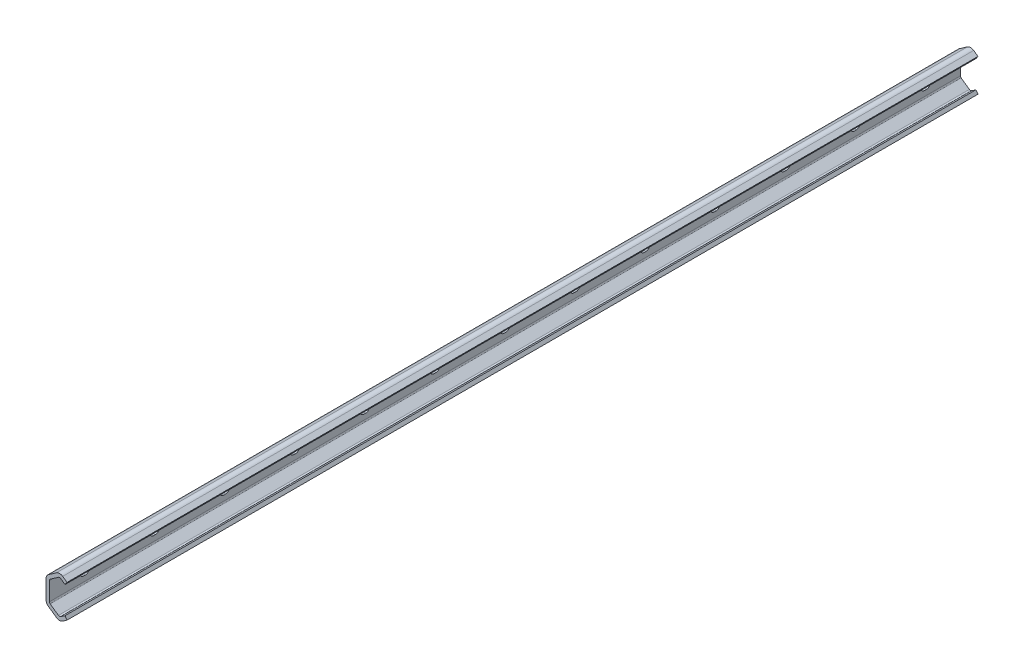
ISO-10303-21;
HEADER;
FILE_DESCRIPTION(('STEP AP214'),'2;1');
FILE_NAME('part.step','',(''),(''),'','','');
FILE_SCHEMA(('AUTOMOTIVE_DESIGN { 1 0 10303 214 1 1 1 1 }'));
ENDSEC;
DATA;
#1=APPLICATION_CONTEXT('core data for automotive mechanical design processes');
#2=APPLICATION_PROTOCOL_DEFINITION('international standard','automotive_design',2000,#1);
#3=PRODUCT_CONTEXT('',#1,'mechanical');
#4=PRODUCT('Part','Part','',(#3));
#5=PRODUCT_RELATED_PRODUCT_CATEGORY('part','',(#4));
#6=PRODUCT_DEFINITION_FORMATION('','',#4);
#7=PRODUCT_DEFINITION_CONTEXT('part definition',#1,'design');
#8=PRODUCT_DEFINITION('design','',#6,#7);
#9=PRODUCT_DEFINITION_SHAPE('','',#8);
#10=(LENGTH_UNIT() NAMED_UNIT(*) SI_UNIT(.MILLI.,.METRE.));
#11=(NAMED_UNIT(*) PLANE_ANGLE_UNIT() SI_UNIT($,.RADIAN.));
#12=(NAMED_UNIT(*) SI_UNIT($,.STERADIAN.) SOLID_ANGLE_UNIT());
#13=UNCERTAINTY_MEASURE_WITH_UNIT(LENGTH_MEASURE(1.E-05),#10,'distance_accuracy_value','');
#14=(GEOMETRIC_REPRESENTATION_CONTEXT(3) GLOBAL_UNCERTAINTY_ASSIGNED_CONTEXT((#13)) GLOBAL_UNIT_ASSIGNED_CONTEXT((#10,
#11,#12)) REPRESENTATION_CONTEXT('',''));
#15=CARTESIAN_POINT('',(0.,0.,0.));
#16=DIRECTION('',(0.,0.,1.));
#17=DIRECTION('',(1.,0.,0.));
#18=AXIS2_PLACEMENT_3D('',#15,#16,#17);
#19=CARTESIAN_POINT('',(16.8139924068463,-18.8268342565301,-1040.));
#20=DIRECTION('',(-0.573576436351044,0.819152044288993,0.));
#21=DIRECTION('',(-0.819152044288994,-0.573576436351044,0.));
#22=AXIS2_PLACEMENT_3D('',#19,#20,#21);
#23=PLANE('',#22);
#24=DIRECTION('',(-0.819152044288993,-0.573576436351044,0.));
#25=VECTOR('',#24,1.);
#26=CARTESIAN_POINT('',(16.8139924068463,-18.8268342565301,0.));
#27=LINE('',#26,#25);
#28=CARTESIAN_POINT('',(21.7056942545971,-15.4016277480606,0.));
#29=VERTEX_POINT('',#28);
#30=CARTESIAN_POINT('',(16.8139924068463,-18.8268342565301,0.));
#31=VERTEX_POINT('',#30);
#32=EDGE_CURVE('E580',#29,#31,#27,.T.);
#33=ORIENTED_EDGE('',*,*,#32,.F.);
#34=DIRECTION('',(0.,0.,1.));
#35=VECTOR('',#34,1.);
#36=CARTESIAN_POINT('',(21.7056942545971,-15.4016277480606,-1040.));
#37=LINE('',#36,#35);
#38=CARTESIAN_POINT('',(21.7056942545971,-15.4016277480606,-1040.));
#39=VERTEX_POINT('',#38);
#40=EDGE_CURVE('E749',#39,#29,#37,.T.);
#41=ORIENTED_EDGE('',*,*,#40,.F.);
#42=DIRECTION('',(-0.819152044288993,-0.573576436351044,0.));
#43=VECTOR('',#42,1.);
#44=CARTESIAN_POINT('',(16.8139924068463,-18.8268342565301,-1040.));
#45=LINE('',#44,#43);
#46=CARTESIAN_POINT('',(16.8139924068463,-18.8268342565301,-1040.));
#47=VERTEX_POINT('',#46);
#48=EDGE_CURVE('E590',#39,#47,#45,.T.);
#49=ORIENTED_EDGE('',*,*,#48,.T.);
#50=DIRECTION('',(0.,0.,1.));
#51=VECTOR('',#50,1.);
#52=CARTESIAN_POINT('',(16.8139924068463,-18.8268342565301,-1040.));
#53=LINE('',#52,#51);
#54=EDGE_CURVE('E671',#47,#31,#53,.T.);
#55=ORIENTED_EDGE('',*,*,#54,.T.);
#56=EDGE_LOOP('',(#33,#41,#49,#55));
#57=FACE_BOUND('',#56,.T.);
#58=ADVANCED_FACE('F39',(#57),#23,.T.);
#59=CARTESIAN_POINT('',(21.7056942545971,-15.4016277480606,-1040.));
#60=DIRECTION('',(0.819152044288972,0.573576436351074,0.));
#61=DIRECTION('',(-0.573576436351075,0.819152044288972,0.));
#62=AXIS2_PLACEMENT_3D('',#59,#60,#61);
#63=PLANE('',#62);
#64=DIRECTION('',(-0.573576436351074,0.819152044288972,0.));
#65=VECTOR('',#64,1.);
#66=CARTESIAN_POINT('',(21.7056942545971,-15.4016277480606,0.));
#67=LINE('',#66,#65);
#68=CARTESIAN_POINT('',(24.0000000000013,-18.6782359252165,0.));
#69=VERTEX_POINT('',#68);
#70=EDGE_CURVE('E595',#69,#29,#67,.T.);
#71=ORIENTED_EDGE('',*,*,#70,.F.);
#72=DIRECTION('',(0.,0.,1.));
#73=VECTOR('',#72,1.);
#74=CARTESIAN_POINT('',(24.0000000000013,-18.6782359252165,-1040.));
#75=LINE('',#74,#73);
#76=CARTESIAN_POINT('',(24.0000000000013,-18.6782359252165,-1040.));
#77=VERTEX_POINT('',#76);
#78=EDGE_CURVE('E753',#77,#69,#75,.T.);
#79=ORIENTED_EDGE('',*,*,#78,.F.);
#80=DIRECTION('',(-0.573576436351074,0.819152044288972,0.));
#81=VECTOR('',#80,1.);
#82=CARTESIAN_POINT('',(21.7056942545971,-15.4016277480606,-1040.));
#83=LINE('',#82,#81);
#84=EDGE_CURVE('E667',#77,#39,#83,.T.);
#85=ORIENTED_EDGE('',*,*,#84,.T.);
#86=ORIENTED_EDGE('',*,*,#40,.T.);
#87=EDGE_LOOP('',(#71,#79,#85,#86));
#88=FACE_BOUND('',#87,.T.);
#89=ADVANCED_FACE('F1300',(#88),#63,.T.);
#90=CARTESIAN_POINT('',(24.0000000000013,-18.6782359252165,-1040.));
#91=DIRECTION('',(0.573576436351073,-0.819152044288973,0.));
#92=DIRECTION('',(0.819152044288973,0.573576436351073,0.));
#93=AXIS2_PLACEMENT_3D('',#90,#91,#92);
#94=PLANE('',#93);
#95=DIRECTION('',(0.819152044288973,0.573576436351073,0.));
#96=VECTOR('',#95,1.);
#97=CARTESIAN_POINT('',(24.0000000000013,-18.6782359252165,0.));
#98=LINE('',#97,#96);
#99=CARTESIAN_POINT('',(19.036236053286,-22.1539008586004,0.));
#100=VERTEX_POINT('',#99);
#101=EDGE_CURVE('E742',#100,#69,#98,.T.);
#102=ORIENTED_EDGE('',*,*,#101,.F.);
#103=DIRECTION('',(0.,0.,1.));
#104=VECTOR('',#103,1.);
#105=CARTESIAN_POINT('',(19.036236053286,-22.1539008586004,-1040.));
#106=LINE('',#105,#104);
#107=CARTESIAN_POINT('',(19.036236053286,-22.1539008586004,-1040.));
#108=VERTEX_POINT('',#107);
#109=EDGE_CURVE('E756',#108,#100,#106,.T.);
#110=ORIENTED_EDGE('',*,*,#109,.F.);
#111=DIRECTION('',(0.819152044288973,0.573576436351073,0.));
#112=VECTOR('',#111,1.);
#113=CARTESIAN_POINT('',(24.0000000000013,-18.6782359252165,-1040.));
#114=LINE('',#113,#112);
#115=EDGE_CURVE('E663',#108,#77,#114,.T.);
#116=ORIENTED_EDGE('',*,*,#115,.T.);
#117=ORIENTED_EDGE('',*,*,#78,.T.);
#118=EDGE_LOOP('',(#102,#110,#116,#117));
#119=FACE_BOUND('',#118,.T.);
#120=ADVANCED_FACE('F1306',(#119),#94,.T.);
#121=CARTESIAN_POINT('',(15.5000000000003,-17.1036323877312,-1040.));
#122=DIRECTION('',(0.,0.,1.));
#123=DIRECTION('',(1.,0.,0.));
#124=AXIS2_PLACEMENT_3D('',#121,#122,#123);
#125=CYLINDRICAL_SURFACE('',#124,6.16523941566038);
#126=CARTESIAN_POINT('',(15.5000000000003,-17.1036323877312,0.));
#127=DIRECTION('',(0.,0.,1.));
#128=DIRECTION('',(-1.,0.,0.));
#129=AXIS2_PLACEMENT_3D('',#126,#127,#128);
#130=CIRCLE('',#129,6.16523941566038);
#131=CARTESIAN_POINT('',(11.9637639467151,-22.1539008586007,0.));
#132=VERTEX_POINT('',#131);
#133=EDGE_CURVE('E738',#132,#100,#130,.T.);
#134=ORIENTED_EDGE('',*,*,#133,.F.);
#135=DIRECTION('',(0.,0.,1.));
#136=VECTOR('',#135,1.);
#137=CARTESIAN_POINT('',(11.9637639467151,-22.1539008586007,-1040.));
#138=LINE('',#137,#136);
#139=CARTESIAN_POINT('',(11.9637639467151,-22.1539008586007,-1040.));
#140=VERTEX_POINT('',#139);
#141=EDGE_CURVE('E759',#140,#132,#138,.T.);
#142=ORIENTED_EDGE('',*,*,#141,.F.);
#143=CARTESIAN_POINT('',(15.5000000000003,-17.1036323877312,-1040.));
#144=DIRECTION('',(0.,0.,1.));
#145=DIRECTION('',(-1.,0.,0.));
#146=AXIS2_PLACEMENT_3D('',#143,#144,#145);
#147=CIRCLE('',#146,6.16523941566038);
#148=EDGE_CURVE('E659',#140,#108,#147,.T.);
#149=ORIENTED_EDGE('',*,*,#148,.T.);
#150=ORIENTED_EDGE('',*,*,#109,.T.);
#151=EDGE_LOOP('',(#134,#142,#149,#150));
#152=FACE_BOUND('',#151,.T.);
#153=ADVANCED_FACE('F1525',(#152),#125,.T.);
#154=CARTESIAN_POINT('',(11.9637639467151,-22.1539008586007,-1040.));
#155=DIRECTION('',(-0.573576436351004,-0.819152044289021,0.));
#156=DIRECTION('',(0.819152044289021,-0.573576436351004,0.));
#157=AXIS2_PLACEMENT_3D('',#154,#155,#156);
#158=PLANE('',#157);
#159=DIRECTION('',(0.819152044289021,-0.573576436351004,0.));
#160=VECTOR('',#159,1.);
#161=CARTESIAN_POINT('',(11.9637639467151,-22.1539008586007,0.));
#162=LINE('',#161,#160);
#163=CARTESIAN_POINT('',(3.37185235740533,-16.1377795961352,0.));
#164=VERTEX_POINT('',#163);
#165=EDGE_CURVE('E734',#164,#132,#162,.T.);
#166=ORIENTED_EDGE('',*,*,#165,.F.);
#167=DIRECTION('',(0.,0.,1.));
#168=VECTOR('',#167,1.);
#169=CARTESIAN_POINT('',(3.37185235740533,-16.1377795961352,-1040.));
#170=LINE('',#169,#168);
#171=CARTESIAN_POINT('',(3.37185235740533,-16.1377795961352,-1040.));
#172=VERTEX_POINT('',#171);
#173=EDGE_CURVE('E762',#172,#164,#170,.T.);
#174=ORIENTED_EDGE('',*,*,#173,.F.);
#175=DIRECTION('',(0.819152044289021,-0.573576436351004,0.));
#176=VECTOR('',#175,1.);
#177=CARTESIAN_POINT('',(11.9637639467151,-22.1539008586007,-1040.));
#178=LINE('',#177,#176);
#179=EDGE_CURVE('E655',#172,#140,#178,.T.);
#180=ORIENTED_EDGE('',*,*,#179,.T.);
#181=ORIENTED_EDGE('',*,*,#141,.T.);
#182=EDGE_LOOP('',(#166,#174,#180,#181));
#183=FACE_BOUND('',#182,.T.);
#184=ADVANCED_FACE('F1529',(#183),#158,.T.);
#185=CARTESIAN_POINT('',(6.50000000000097,-10.440000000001,-1040.));
#186=DIRECTION('',(0.,0.,1.));
#187=DIRECTION('',(1.,0.,0.));
#188=AXIS2_PLACEMENT_3D('',#185,#186,#187);
#189=CYLINDRICAL_SURFACE('',#188,6.50000000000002);
#190=CARTESIAN_POINT('',(6.50000000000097,-10.440000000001,0.));
#191=DIRECTION('',(0.,0.,1.));
#192=DIRECTION('',(1.,0.,0.));
#193=AXIS2_PLACEMENT_3D('',#190,#191,#192);
#194=CIRCLE('',#193,6.50000000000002);
#195=CARTESIAN_POINT('',(9.51495826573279E-13,-10.440000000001,0.));
#196=VERTEX_POINT('',#195);
#197=EDGE_CURVE('E730',#196,#164,#194,.T.);
#198=ORIENTED_EDGE('',*,*,#197,.F.);
#199=DIRECTION('',(0.,0.,1.));
#200=VECTOR('',#199,1.);
#201=CARTESIAN_POINT('',(9.51495826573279E-13,-10.440000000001,-1040.));
#202=LINE('',#201,#200);
#203=CARTESIAN_POINT('',(9.51495826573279E-13,-10.440000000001,-1040.));
#204=VERTEX_POINT('',#203);
#205=EDGE_CURVE('E765',#204,#196,#202,.T.);
#206=ORIENTED_EDGE('',*,*,#205,.F.);
#207=CARTESIAN_POINT('',(6.50000000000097,-10.440000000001,-1040.));
#208=DIRECTION('',(0.,0.,1.));
#209=DIRECTION('',(1.,0.,0.));
#210=AXIS2_PLACEMENT_3D('',#207,#208,#209);
#211=CIRCLE('',#210,6.50000000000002);
#212=EDGE_CURVE('E651',#204,#172,#211,.T.);
#213=ORIENTED_EDGE('',*,*,#212,.T.);
#214=ORIENTED_EDGE('',*,*,#173,.T.);
#215=EDGE_LOOP('',(#198,#206,#213,#214));
#216=FACE_BOUND('',#215,.T.);
#217=ADVANCED_FACE('F1534',(#216),#189,.T.);
#218=CARTESIAN_POINT('',(9.5062846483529E-13,-10.440000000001,-1040.));
#219=DIRECTION('',(-1.,0.,0.));
#220=DIRECTION('',(0.,-1.,0.));
#221=AXIS2_PLACEMENT_3D('',#218,#219,#220);
#222=PLANE('',#221);
#223=CARTESIAN_POINT('',(7.40726924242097E-13,0.,-119.));
#224=DIRECTION('',(1.,0.,0.));
#225=DIRECTION('',(0.,1.,0.));
#226=AXIS2_PLACEMENT_3D('',#223,#224,#225);
#227=CIRCLE('',#226,4.5);
#228=CARTESIAN_POINT('',(7.40726924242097E-13,4.5,-119.));
#229=VERTEX_POINT('',#228);
#230=CARTESIAN_POINT('',(7.40726924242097E-13,-4.5,-119.));
#231=VERTEX_POINT('',#230);
#232=EDGE_CURVE('E541',#229,#231,#227,.T.);
#233=ORIENTED_EDGE('',*,*,#232,.T.);
#234=DIRECTION('',(0.,0.,-1.));
#235=VECTOR('',#234,1.);
#236=CARTESIAN_POINT('',(7.40726924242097E-13,-4.5,-119.));
#237=LINE('',#236,#235);
#238=CARTESIAN_POINT('',(9.5112196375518E-13,-4.5,-121.));
#239=VERTEX_POINT('',#238);
#240=EDGE_CURVE('E502',#231,#239,#237,.T.);
#241=ORIENTED_EDGE('',*,*,#240,.T.);
#242=CARTESIAN_POINT('',(7.40726924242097E-13,0.,-121.));
#243=DIRECTION('',(1.,0.,0.));
#244=DIRECTION('',(0.,-1.,0.));
#245=AXIS2_PLACEMENT_3D('',#242,#243,#244);
#246=CIRCLE('',#245,4.5);
#247=CARTESIAN_POINT('',(7.40726924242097E-13,4.5,-121.));
#248=VERTEX_POINT('',#247);
#249=EDGE_CURVE('E509',#239,#248,#246,.T.);
#250=ORIENTED_EDGE('',*,*,#249,.T.);
#251=DIRECTION('',(0.,0.,1.));
#252=VECTOR('',#251,1.);
#253=CARTESIAN_POINT('',(7.40726924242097E-13,4.5,-119.));
#254=LINE('',#253,#252);
#255=EDGE_CURVE('E534',#248,#229,#254,.T.);
#256=ORIENTED_EDGE('',*,*,#255,.T.);
#257=EDGE_LOOP('',(#233,#241,#250,#256));
#258=FACE_BOUND('',#257,.T.);
#259=CARTESIAN_POINT('',(7.40726924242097E-13,0.,-39.));
#260=DIRECTION('',(1.,0.,0.));
#261=DIRECTION('',(0.,1.,0.));
#262=AXIS2_PLACEMENT_3D('',#259,#260,#261);
#263=CIRCLE('',#262,4.5);
#264=CARTESIAN_POINT('',(7.40726924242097E-13,4.5,-39.));
#265=VERTEX_POINT('',#264);
#266=CARTESIAN_POINT('',(7.40726924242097E-13,-4.5,-39.));
#267=VERTEX_POINT('',#266);
#268=EDGE_CURVE('E546',#265,#267,#263,.T.);
#269=ORIENTED_EDGE('',*,*,#268,.T.);
#270=DIRECTION('',(0.,0.,-1.));
#271=VECTOR('',#270,1.);
#272=CARTESIAN_POINT('',(7.40726924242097E-13,-4.5,-39.));
#273=LINE('',#272,#271);
#274=CARTESIAN_POINT('',(9.5112196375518E-13,-4.5,-40.9999999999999));
#275=VERTEX_POINT('',#274);
#276=EDGE_CURVE('E550',#267,#275,#273,.T.);
#277=ORIENTED_EDGE('',*,*,#276,.T.);
#278=CARTESIAN_POINT('',(7.40726924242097E-13,0.,-41.));
#279=DIRECTION('',(1.,0.,0.));
#280=DIRECTION('',(0.,-1.,0.));
#281=AXIS2_PLACEMENT_3D('',#278,#279,#280);
#282=CIRCLE('',#281,4.5);
#283=CARTESIAN_POINT('',(7.40726924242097E-13,4.5,-41.));
#284=VERTEX_POINT('',#283);
#285=EDGE_CURVE('E555',#275,#284,#282,.T.);
#286=ORIENTED_EDGE('',*,*,#285,.T.);
#287=DIRECTION('',(0.,0.,1.));
#288=VECTOR('',#287,1.);
#289=CARTESIAN_POINT('',(7.40726924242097E-13,4.5,-39.));
#290=LINE('',#289,#288);
#291=EDGE_CURVE('E559',#284,#265,#290,.T.);
#292=ORIENTED_EDGE('',*,*,#291,.T.);
#293=EDGE_LOOP('',(#269,#277,#286,#292));
#294=FACE_BOUND('',#293,.T.);
#295=DIRECTION('',(0.,-1.,0.));
#296=VECTOR('',#295,1.);
#297=CARTESIAN_POINT('',(9.5062846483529E-13,-10.440000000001,0.));
#298=LINE('',#297,#296);
#299=CARTESIAN_POINT('',(9.52363188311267E-13,10.4399999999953,0.));
#300=VERTEX_POINT('',#299);
#301=EDGE_CURVE('E726',#300,#196,#298,.T.);
#302=ORIENTED_EDGE('',*,*,#301,.F.);
#303=DIRECTION('',(0.,0.,1.));
#304=VECTOR('',#303,1.);
#305=CARTESIAN_POINT('',(9.52363188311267E-13,10.4399999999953,-1040.));
#306=LINE('',#305,#304);
#307=CARTESIAN_POINT('',(9.52363188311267E-13,10.4399999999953,-1040.));
#308=VERTEX_POINT('',#307);
#309=EDGE_CURVE('E768',#308,#300,#306,.T.);
#310=ORIENTED_EDGE('',*,*,#309,.F.);
#311=DIRECTION('',(0.,-1.,0.));
#312=VECTOR('',#311,1.);
#313=CARTESIAN_POINT('',(9.5062846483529E-13,-10.440000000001,-1040.));
#314=LINE('',#313,#312);
#315=EDGE_CURVE('E647',#308,#204,#314,.T.);
#316=ORIENTED_EDGE('',*,*,#315,.T.);
#317=ORIENTED_EDGE('',*,*,#205,.T.);
#318=EDGE_LOOP('',(#302,#310,#316,#317));
#319=FACE_BOUND('',#318,.T.);
#320=CARTESIAN_POINT('',(7.40726924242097E-13,0.,-199.));
#321=DIRECTION('',(1.,0.,0.));
#322=DIRECTION('',(0.,1.,0.));
#323=AXIS2_PLACEMENT_3D('',#320,#321,#322);
#324=CIRCLE('',#323,4.5);
#325=CARTESIAN_POINT('',(7.40726924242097E-13,4.5,-199.));
#326=VERTEX_POINT('',#325);
#327=CARTESIAN_POINT('',(7.40726924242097E-13,-4.5,-199.));
#328=VERTEX_POINT('',#327);
#329=EDGE_CURVE('E822',#326,#328,#324,.T.);
#330=ORIENTED_EDGE('',*,*,#329,.T.);
#331=DIRECTION('',(0.,0.,-1.));
#332=VECTOR('',#331,1.);
#333=CARTESIAN_POINT('',(7.40726924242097E-13,-4.5,-199.));
#334=LINE('',#333,#332);
#335=CARTESIAN_POINT('',(9.5112196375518E-13,-4.5,-201.));
#336=VERTEX_POINT('',#335);
#337=EDGE_CURVE('E825',#328,#336,#334,.T.);
#338=ORIENTED_EDGE('',*,*,#337,.T.);
#339=CARTESIAN_POINT('',(7.40726924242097E-13,0.,-201.));
#340=DIRECTION('',(1.,0.,0.));
#341=DIRECTION('',(0.,-1.,0.));
#342=AXIS2_PLACEMENT_3D('',#339,#340,#341);
#343=CIRCLE('',#342,4.5);
#344=CARTESIAN_POINT('',(7.40726924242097E-13,4.5,-201.));
#345=VERTEX_POINT('',#344);
#346=EDGE_CURVE('E828',#336,#345,#343,.T.);
#347=ORIENTED_EDGE('',*,*,#346,.T.);
#348=DIRECTION('',(0.,0.,1.));
#349=VECTOR('',#348,1.);
#350=CARTESIAN_POINT('',(7.40726924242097E-13,4.5,-199.));
#351=LINE('',#350,#349);
#352=EDGE_CURVE('E831',#345,#326,#351,.T.);
#353=ORIENTED_EDGE('',*,*,#352,.T.);
#354=EDGE_LOOP('',(#330,#338,#347,#353));
#355=FACE_BOUND('',#354,.T.);
#356=CARTESIAN_POINT('',(7.40726924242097E-13,0.,-279.));
#357=DIRECTION('',(1.,0.,0.));
#358=DIRECTION('',(0.,1.,0.));
#359=AXIS2_PLACEMENT_3D('',#356,#357,#358);
#360=CIRCLE('',#359,4.5);
#361=CARTESIAN_POINT('',(7.40726924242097E-13,4.5,-279.));
#362=VERTEX_POINT('',#361);
#363=CARTESIAN_POINT('',(7.40726924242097E-13,-4.5,-279.));
#364=VERTEX_POINT('',#363);
#365=EDGE_CURVE('E866',#362,#364,#360,.T.);
#366=ORIENTED_EDGE('',*,*,#365,.T.);
#367=DIRECTION('',(0.,0.,-1.));
#368=VECTOR('',#367,1.);
#369=CARTESIAN_POINT('',(7.40726924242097E-13,-4.5,-279.));
#370=LINE('',#369,#368);
#371=CARTESIAN_POINT('',(9.5112196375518E-13,-4.5,-281.));
#372=VERTEX_POINT('',#371);
#373=EDGE_CURVE('E869',#364,#372,#370,.T.);
#374=ORIENTED_EDGE('',*,*,#373,.T.);
#375=CARTESIAN_POINT('',(7.40726924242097E-13,0.,-281.));
#376=DIRECTION('',(1.,0.,0.));
#377=DIRECTION('',(0.,-1.,0.));
#378=AXIS2_PLACEMENT_3D('',#375,#376,#377);
#379=CIRCLE('',#378,4.5);
#380=CARTESIAN_POINT('',(7.40726924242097E-13,4.5,-281.));
#381=VERTEX_POINT('',#380);
#382=EDGE_CURVE('E872',#372,#381,#379,.T.);
#383=ORIENTED_EDGE('',*,*,#382,.T.);
#384=DIRECTION('',(0.,0.,1.));
#385=VECTOR('',#384,1.);
#386=CARTESIAN_POINT('',(7.40726924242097E-13,4.5,-279.));
#387=LINE('',#386,#385);
#388=EDGE_CURVE('E875',#381,#362,#387,.T.);
#389=ORIENTED_EDGE('',*,*,#388,.T.);
#390=EDGE_LOOP('',(#366,#374,#383,#389));
#391=FACE_BOUND('',#390,.T.);
#392=CARTESIAN_POINT('',(7.40726924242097E-13,0.,-359.));
#393=DIRECTION('',(1.,0.,0.));
#394=DIRECTION('',(0.,1.,0.));
#395=AXIS2_PLACEMENT_3D('',#392,#393,#394);
#396=CIRCLE('',#395,4.5);
#397=CARTESIAN_POINT('',(7.40726924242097E-13,4.5,-359.));
#398=VERTEX_POINT('',#397);
#399=CARTESIAN_POINT('',(7.40726924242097E-13,-4.5,-359.));
#400=VERTEX_POINT('',#399);
#401=EDGE_CURVE('E910',#398,#400,#396,.T.);
#402=ORIENTED_EDGE('',*,*,#401,.T.);
#403=DIRECTION('',(0.,0.,-1.));
#404=VECTOR('',#403,1.);
#405=CARTESIAN_POINT('',(7.40726924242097E-13,-4.5,-359.));
#406=LINE('',#405,#404);
#407=CARTESIAN_POINT('',(9.5112196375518E-13,-4.5,-361.));
#408=VERTEX_POINT('',#407);
#409=EDGE_CURVE('E913',#400,#408,#406,.T.);
#410=ORIENTED_EDGE('',*,*,#409,.T.);
#411=CARTESIAN_POINT('',(7.40726924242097E-13,0.,-361.));
#412=DIRECTION('',(1.,0.,0.));
#413=DIRECTION('',(0.,-1.,0.));
#414=AXIS2_PLACEMENT_3D('',#411,#412,#413);
#415=CIRCLE('',#414,4.5);
#416=CARTESIAN_POINT('',(7.40726924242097E-13,4.5,-361.));
#417=VERTEX_POINT('',#416);
#418=EDGE_CURVE('E916',#408,#417,#415,.T.);
#419=ORIENTED_EDGE('',*,*,#418,.T.);
#420=DIRECTION('',(0.,0.,1.));
#421=VECTOR('',#420,1.);
#422=CARTESIAN_POINT('',(7.40726924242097E-13,4.5,-359.));
#423=LINE('',#422,#421);
#424=EDGE_CURVE('E919',#417,#398,#423,.T.);
#425=ORIENTED_EDGE('',*,*,#424,.T.);
#426=EDGE_LOOP('',(#402,#410,#419,#425));
#427=FACE_BOUND('',#426,.T.);
#428=CARTESIAN_POINT('',(7.40726924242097E-13,0.,-439.));
#429=DIRECTION('',(1.,0.,0.));
#430=DIRECTION('',(0.,1.,0.));
#431=AXIS2_PLACEMENT_3D('',#428,#429,#430);
#432=CIRCLE('',#431,4.5);
#433=CARTESIAN_POINT('',(7.40726924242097E-13,4.5,-439.));
#434=VERTEX_POINT('',#433);
#435=CARTESIAN_POINT('',(7.40726924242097E-13,-4.5,-439.));
#436=VERTEX_POINT('',#435);
#437=EDGE_CURVE('E954',#434,#436,#432,.T.);
#438=ORIENTED_EDGE('',*,*,#437,.T.);
#439=DIRECTION('',(0.,0.,-1.));
#440=VECTOR('',#439,1.);
#441=CARTESIAN_POINT('',(7.40726924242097E-13,-4.5,-439.));
#442=LINE('',#441,#440);
#443=CARTESIAN_POINT('',(9.5112196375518E-13,-4.5,-441.));
#444=VERTEX_POINT('',#443);
#445=EDGE_CURVE('E957',#436,#444,#442,.T.);
#446=ORIENTED_EDGE('',*,*,#445,.T.);
#447=CARTESIAN_POINT('',(7.40726924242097E-13,0.,-441.));
#448=DIRECTION('',(1.,0.,0.));
#449=DIRECTION('',(0.,-1.,0.));
#450=AXIS2_PLACEMENT_3D('',#447,#448,#449);
#451=CIRCLE('',#450,4.5);
#452=CARTESIAN_POINT('',(7.40726924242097E-13,4.5,-441.));
#453=VERTEX_POINT('',#452);
#454=EDGE_CURVE('E960',#444,#453,#451,.T.);
#455=ORIENTED_EDGE('',*,*,#454,.T.);
#456=DIRECTION('',(0.,0.,1.));
#457=VECTOR('',#456,1.);
#458=CARTESIAN_POINT('',(7.40726924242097E-13,4.5,-439.));
#459=LINE('',#458,#457);
#460=EDGE_CURVE('E963',#453,#434,#459,.T.);
#461=ORIENTED_EDGE('',*,*,#460,.T.);
#462=EDGE_LOOP('',(#438,#446,#455,#461));
#463=FACE_BOUND('',#462,.T.);
#464=CARTESIAN_POINT('',(7.40726924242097E-13,0.,-519.));
#465=DIRECTION('',(1.,0.,0.));
#466=DIRECTION('',(0.,1.,0.));
#467=AXIS2_PLACEMENT_3D('',#464,#465,#466);
#468=CIRCLE('',#467,4.5);
#469=CARTESIAN_POINT('',(7.40726924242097E-13,4.5,-519.));
#470=VERTEX_POINT('',#469);
#471=CARTESIAN_POINT('',(7.40726924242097E-13,-4.5,-519.));
#472=VERTEX_POINT('',#471);
#473=EDGE_CURVE('E998',#470,#472,#468,.T.);
#474=ORIENTED_EDGE('',*,*,#473,.T.);
#475=DIRECTION('',(0.,0.,-1.));
#476=VECTOR('',#475,1.);
#477=CARTESIAN_POINT('',(7.40726924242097E-13,-4.5,-519.));
#478=LINE('',#477,#476);
#479=CARTESIAN_POINT('',(9.5112196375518E-13,-4.5,-521.));
#480=VERTEX_POINT('',#479);
#481=EDGE_CURVE('E1001',#472,#480,#478,.T.);
#482=ORIENTED_EDGE('',*,*,#481,.T.);
#483=CARTESIAN_POINT('',(7.40726924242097E-13,0.,-521.));
#484=DIRECTION('',(1.,0.,0.));
#485=DIRECTION('',(0.,-1.,0.));
#486=AXIS2_PLACEMENT_3D('',#483,#484,#485);
#487=CIRCLE('',#486,4.5);
#488=CARTESIAN_POINT('',(7.40726924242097E-13,4.5,-521.));
#489=VERTEX_POINT('',#488);
#490=EDGE_CURVE('E1004',#480,#489,#487,.T.);
#491=ORIENTED_EDGE('',*,*,#490,.T.);
#492=DIRECTION('',(0.,0.,1.));
#493=VECTOR('',#492,1.);
#494=CARTESIAN_POINT('',(7.40726924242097E-13,4.5,-519.));
#495=LINE('',#494,#493);
#496=EDGE_CURVE('E1007',#489,#470,#495,.T.);
#497=ORIENTED_EDGE('',*,*,#496,.T.);
#498=EDGE_LOOP('',(#474,#482,#491,#497));
#499=FACE_BOUND('',#498,.T.);
#500=CARTESIAN_POINT('',(7.40726924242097E-13,0.,-599.));
#501=DIRECTION('',(1.,0.,0.));
#502=DIRECTION('',(0.,1.,0.));
#503=AXIS2_PLACEMENT_3D('',#500,#501,#502);
#504=CIRCLE('',#503,4.5);
#505=CARTESIAN_POINT('',(7.40726924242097E-13,4.5,-599.));
#506=VERTEX_POINT('',#505);
#507=CARTESIAN_POINT('',(7.40726924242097E-13,-4.5,-599.));
#508=VERTEX_POINT('',#507);
#509=EDGE_CURVE('E1042',#506,#508,#504,.T.);
#510=ORIENTED_EDGE('',*,*,#509,.T.);
#511=DIRECTION('',(0.,0.,-1.));
#512=VECTOR('',#511,1.);
#513=CARTESIAN_POINT('',(7.40726924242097E-13,-4.5,-599.));
#514=LINE('',#513,#512);
#515=CARTESIAN_POINT('',(9.5112196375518E-13,-4.5,-601.));
#516=VERTEX_POINT('',#515);
#517=EDGE_CURVE('E1045',#508,#516,#514,.T.);
#518=ORIENTED_EDGE('',*,*,#517,.T.);
#519=CARTESIAN_POINT('',(7.40726924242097E-13,0.,-601.));
#520=DIRECTION('',(1.,0.,0.));
#521=DIRECTION('',(0.,-1.,0.));
#522=AXIS2_PLACEMENT_3D('',#519,#520,#521);
#523=CIRCLE('',#522,4.5);
#524=CARTESIAN_POINT('',(7.40726924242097E-13,4.5,-601.));
#525=VERTEX_POINT('',#524);
#526=EDGE_CURVE('E1048',#516,#525,#523,.T.);
#527=ORIENTED_EDGE('',*,*,#526,.T.);
#528=DIRECTION('',(0.,0.,1.));
#529=VECTOR('',#528,1.);
#530=CARTESIAN_POINT('',(7.40726924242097E-13,4.5,-599.));
#531=LINE('',#530,#529);
#532=EDGE_CURVE('E1051',#525,#506,#531,.T.);
#533=ORIENTED_EDGE('',*,*,#532,.T.);
#534=EDGE_LOOP('',(#510,#518,#527,#533));
#535=FACE_BOUND('',#534,.T.);
#536=CARTESIAN_POINT('',(7.40726924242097E-13,0.,-679.));
#537=DIRECTION('',(1.,0.,0.));
#538=DIRECTION('',(0.,1.,0.));
#539=AXIS2_PLACEMENT_3D('',#536,#537,#538);
#540=CIRCLE('',#539,4.5);
#541=CARTESIAN_POINT('',(7.40726924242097E-13,4.5,-679.));
#542=VERTEX_POINT('',#541);
#543=CARTESIAN_POINT('',(7.40726924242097E-13,-4.5,-679.));
#544=VERTEX_POINT('',#543);
#545=EDGE_CURVE('E1086',#542,#544,#540,.T.);
#546=ORIENTED_EDGE('',*,*,#545,.T.);
#547=DIRECTION('',(0.,0.,-1.));
#548=VECTOR('',#547,1.);
#549=CARTESIAN_POINT('',(7.40726924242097E-13,-4.5,-679.));
#550=LINE('',#549,#548);
#551=CARTESIAN_POINT('',(9.5112196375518E-13,-4.5,-681.));
#552=VERTEX_POINT('',#551);
#553=EDGE_CURVE('E1089',#544,#552,#550,.T.);
#554=ORIENTED_EDGE('',*,*,#553,.T.);
#555=CARTESIAN_POINT('',(7.40726924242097E-13,0.,-681.));
#556=DIRECTION('',(1.,0.,0.));
#557=DIRECTION('',(0.,-1.,0.));
#558=AXIS2_PLACEMENT_3D('',#555,#556,#557);
#559=CIRCLE('',#558,4.5);
#560=CARTESIAN_POINT('',(7.40726924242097E-13,4.5,-681.));
#561=VERTEX_POINT('',#560);
#562=EDGE_CURVE('E1092',#552,#561,#559,.T.);
#563=ORIENTED_EDGE('',*,*,#562,.T.);
#564=DIRECTION('',(0.,0.,1.));
#565=VECTOR('',#564,1.);
#566=CARTESIAN_POINT('',(7.40726924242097E-13,4.5,-679.));
#567=LINE('',#566,#565);
#568=EDGE_CURVE('E1095',#561,#542,#567,.T.);
#569=ORIENTED_EDGE('',*,*,#568,.T.);
#570=EDGE_LOOP('',(#546,#554,#563,#569));
#571=FACE_BOUND('',#570,.T.);
#572=CARTESIAN_POINT('',(7.40726924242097E-13,0.,-759.));
#573=DIRECTION('',(1.,0.,0.));
#574=DIRECTION('',(0.,1.,0.));
#575=AXIS2_PLACEMENT_3D('',#572,#573,#574);
#576=CIRCLE('',#575,4.5);
#577=CARTESIAN_POINT('',(7.40726924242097E-13,4.5,-759.));
#578=VERTEX_POINT('',#577);
#579=CARTESIAN_POINT('',(7.40726924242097E-13,-4.5,-759.));
#580=VERTEX_POINT('',#579);
#581=EDGE_CURVE('E1130',#578,#580,#576,.T.);
#582=ORIENTED_EDGE('',*,*,#581,.T.);
#583=DIRECTION('',(0.,0.,-1.));
#584=VECTOR('',#583,1.);
#585=CARTESIAN_POINT('',(7.40726924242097E-13,-4.5,-759.));
#586=LINE('',#585,#584);
#587=CARTESIAN_POINT('',(9.5112196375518E-13,-4.5,-761.));
#588=VERTEX_POINT('',#587);
#589=EDGE_CURVE('E1133',#580,#588,#586,.T.);
#590=ORIENTED_EDGE('',*,*,#589,.T.);
#591=CARTESIAN_POINT('',(7.40726924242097E-13,0.,-761.));
#592=DIRECTION('',(1.,0.,0.));
#593=DIRECTION('',(0.,-1.,0.));
#594=AXIS2_PLACEMENT_3D('',#591,#592,#593);
#595=CIRCLE('',#594,4.5);
#596=CARTESIAN_POINT('',(7.40726924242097E-13,4.5,-761.));
#597=VERTEX_POINT('',#596);
#598=EDGE_CURVE('E1136',#588,#597,#595,.T.);
#599=ORIENTED_EDGE('',*,*,#598,.T.);
#600=DIRECTION('',(0.,0.,1.));
#601=VECTOR('',#600,1.);
#602=CARTESIAN_POINT('',(7.40726924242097E-13,4.5,-759.));
#603=LINE('',#602,#601);
#604=EDGE_CURVE('E1139',#597,#578,#603,.T.);
#605=ORIENTED_EDGE('',*,*,#604,.T.);
#606=EDGE_LOOP('',(#582,#590,#599,#605));
#607=FACE_BOUND('',#606,.T.);
#608=CARTESIAN_POINT('',(7.40726924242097E-13,0.,-839.));
#609=DIRECTION('',(1.,0.,0.));
#610=DIRECTION('',(0.,1.,0.));
#611=AXIS2_PLACEMENT_3D('',#608,#609,#610);
#612=CIRCLE('',#611,4.5);
#613=CARTESIAN_POINT('',(7.40726924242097E-13,4.5,-839.));
#614=VERTEX_POINT('',#613);
#615=CARTESIAN_POINT('',(7.40726924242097E-13,-4.5,-839.));
#616=VERTEX_POINT('',#615);
#617=EDGE_CURVE('E1174',#614,#616,#612,.T.);
#618=ORIENTED_EDGE('',*,*,#617,.T.);
#619=DIRECTION('',(0.,0.,-1.));
#620=VECTOR('',#619,1.);
#621=CARTESIAN_POINT('',(7.40726924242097E-13,-4.5,-839.));
#622=LINE('',#621,#620);
#623=CARTESIAN_POINT('',(9.5112196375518E-13,-4.5,-841.));
#624=VERTEX_POINT('',#623);
#625=EDGE_CURVE('E1177',#616,#624,#622,.T.);
#626=ORIENTED_EDGE('',*,*,#625,.T.);
#627=CARTESIAN_POINT('',(7.40726924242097E-13,0.,-841.));
#628=DIRECTION('',(1.,0.,0.));
#629=DIRECTION('',(0.,-1.,0.));
#630=AXIS2_PLACEMENT_3D('',#627,#628,#629);
#631=CIRCLE('',#630,4.5);
#632=CARTESIAN_POINT('',(7.40726924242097E-13,4.5,-841.));
#633=VERTEX_POINT('',#632);
#634=EDGE_CURVE('E1180',#624,#633,#631,.T.);
#635=ORIENTED_EDGE('',*,*,#634,.T.);
#636=DIRECTION('',(0.,0.,1.));
#637=VECTOR('',#636,1.);
#638=CARTESIAN_POINT('',(7.40726924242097E-13,4.5,-839.));
#639=LINE('',#638,#637);
#640=EDGE_CURVE('E1183',#633,#614,#639,.T.);
#641=ORIENTED_EDGE('',*,*,#640,.T.);
#642=EDGE_LOOP('',(#618,#626,#635,#641));
#643=FACE_BOUND('',#642,.T.);
#644=CARTESIAN_POINT('',(7.40726924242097E-13,0.,-919.));
#645=DIRECTION('',(1.,0.,0.));
#646=DIRECTION('',(0.,1.,0.));
#647=AXIS2_PLACEMENT_3D('',#644,#645,#646);
#648=CIRCLE('',#647,4.5);
#649=CARTESIAN_POINT('',(7.40726924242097E-13,4.5,-919.));
#650=VERTEX_POINT('',#649);
#651=CARTESIAN_POINT('',(7.40726924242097E-13,-4.5,-919.));
#652=VERTEX_POINT('',#651);
#653=EDGE_CURVE('E1218',#650,#652,#648,.T.);
#654=ORIENTED_EDGE('',*,*,#653,.T.);
#655=DIRECTION('',(0.,0.,-1.));
#656=VECTOR('',#655,1.);
#657=CARTESIAN_POINT('',(7.40726924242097E-13,-4.5,-919.));
#658=LINE('',#657,#656);
#659=CARTESIAN_POINT('',(9.5112196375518E-13,-4.5,-921.));
#660=VERTEX_POINT('',#659);
#661=EDGE_CURVE('E1221',#652,#660,#658,.T.);
#662=ORIENTED_EDGE('',*,*,#661,.T.);
#663=CARTESIAN_POINT('',(7.40726924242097E-13,0.,-921.));
#664=DIRECTION('',(1.,0.,0.));
#665=DIRECTION('',(0.,-1.,0.));
#666=AXIS2_PLACEMENT_3D('',#663,#664,#665);
#667=CIRCLE('',#666,4.5);
#668=CARTESIAN_POINT('',(7.40726924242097E-13,4.5,-921.));
#669=VERTEX_POINT('',#668);
#670=EDGE_CURVE('E1224',#660,#669,#667,.T.);
#671=ORIENTED_EDGE('',*,*,#670,.T.);
#672=DIRECTION('',(0.,0.,1.));
#673=VECTOR('',#672,1.);
#674=CARTESIAN_POINT('',(7.40726924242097E-13,4.5,-919.));
#675=LINE('',#674,#673);
#676=EDGE_CURVE('E1227',#669,#650,#675,.T.);
#677=ORIENTED_EDGE('',*,*,#676,.T.);
#678=EDGE_LOOP('',(#654,#662,#671,#677));
#679=FACE_BOUND('',#678,.T.);
#680=CARTESIAN_POINT('',(7.40726924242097E-13,0.,-999.));
#681=DIRECTION('',(1.,0.,0.));
#682=DIRECTION('',(0.,1.,0.));
#683=AXIS2_PLACEMENT_3D('',#680,#681,#682);
#684=CIRCLE('',#683,4.5);
#685=CARTESIAN_POINT('',(7.40726924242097E-13,4.5,-999.));
#686=VERTEX_POINT('',#685);
#687=CARTESIAN_POINT('',(7.40726924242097E-13,-4.5,-999.));
#688=VERTEX_POINT('',#687);
#689=EDGE_CURVE('E55',#686,#688,#684,.T.);
#690=ORIENTED_EDGE('',*,*,#689,.T.);
#691=DIRECTION('',(0.,0.,-1.));
#692=VECTOR('',#691,1.);
#693=CARTESIAN_POINT('',(7.40726924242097E-13,-4.5,-999.));
#694=LINE('',#693,#692);
#695=CARTESIAN_POINT('',(9.5112196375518E-13,-4.5,-1001.));
#696=VERTEX_POINT('',#695);
#697=EDGE_CURVE('E1264',#688,#696,#694,.T.);
#698=ORIENTED_EDGE('',*,*,#697,.T.);
#699=CARTESIAN_POINT('',(7.40726924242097E-13,0.,-1001.));
#700=DIRECTION('',(1.,0.,0.));
#701=DIRECTION('',(0.,-1.,0.));
#702=AXIS2_PLACEMENT_3D('',#699,#700,#701);
#703=CIRCLE('',#702,4.5);
#704=CARTESIAN_POINT('',(7.40726924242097E-13,4.5,-1001.));
#705=VERTEX_POINT('',#704);
#706=EDGE_CURVE('E62',#696,#705,#703,.T.);
#707=ORIENTED_EDGE('',*,*,#706,.T.);
#708=DIRECTION('',(0.,0.,1.));
#709=VECTOR('',#708,1.);
#710=CARTESIAN_POINT('',(7.40726924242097E-13,4.5,-999.));
#711=LINE('',#710,#709);
#712=EDGE_CURVE('E1269',#705,#686,#711,.T.);
#713=ORIENTED_EDGE('',*,*,#712,.T.);
#714=EDGE_LOOP('',(#690,#698,#707,#713));
#715=FACE_BOUND('',#714,.T.);
#716=ADVANCED_FACE('F1483',(#258,#294,#319,#355,#391,#427,#463,#499,#535,#571,#607,#643,#679,
#715),#222,.T.);
#717=CARTESIAN_POINT('',(6.50000000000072,10.439999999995,-1040.));
#718=DIRECTION('',(0.,0.,1.));
#719=DIRECTION('',(1.,0.,0.));
#720=AXIS2_PLACEMENT_3D('',#717,#718,#719);
#721=CYLINDRICAL_SURFACE('',#720,6.49999999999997);
#722=CARTESIAN_POINT('',(6.50000000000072,10.439999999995,0.));
#723=DIRECTION('',(0.,0.,1.));
#724=DIRECTION('',(-1.,0.,0.));
#725=AXIS2_PLACEMENT_3D('',#722,#723,#724);
#726=CIRCLE('',#725,6.49999999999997);
#727=CARTESIAN_POINT('',(3.37185235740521,16.1377795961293,0.));
#728=VERTEX_POINT('',#727);
#729=EDGE_CURVE('E722',#728,#300,#726,.T.);
#730=ORIENTED_EDGE('',*,*,#729,.F.);
#731=DIRECTION('',(0.,0.,1.));
#732=VECTOR('',#731,1.);
#733=CARTESIAN_POINT('',(3.37185235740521,16.1377795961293,-1040.));
#734=LINE('',#733,#732);
#735=CARTESIAN_POINT('',(3.37185235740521,16.1377795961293,-1040.));
#736=VERTEX_POINT('',#735);
#737=EDGE_CURVE('E771',#736,#728,#734,.T.);
#738=ORIENTED_EDGE('',*,*,#737,.F.);
#739=CARTESIAN_POINT('',(6.50000000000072,10.439999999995,-1040.));
#740=DIRECTION('',(0.,0.,1.));
#741=DIRECTION('',(-1.,0.,0.));
#742=AXIS2_PLACEMENT_3D('',#739,#740,#741);
#743=CIRCLE('',#742,6.49999999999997);
#744=EDGE_CURVE('E643',#736,#308,#743,.T.);
#745=ORIENTED_EDGE('',*,*,#744,.T.);
#746=ORIENTED_EDGE('',*,*,#309,.T.);
#747=EDGE_LOOP('',(#730,#738,#745,#746));
#748=FACE_BOUND('',#747,.T.);
#749=ADVANCED_FACE('F1542',(#748),#721,.T.);
#750=CARTESIAN_POINT('',(3.37185235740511,16.1377795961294,-1040.));
#751=DIRECTION('',(-0.573576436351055,0.819152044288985,0.));
#752=DIRECTION('',(-0.819152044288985,-0.573576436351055,0.));
#753=AXIS2_PLACEMENT_3D('',#750,#751,#752);
#754=PLANE('',#753);
#755=DIRECTION('',(-0.819152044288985,-0.573576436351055,0.));
#756=VECTOR('',#755,1.);
#757=CARTESIAN_POINT('',(3.37185235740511,16.1377795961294,0.));
#758=LINE('',#757,#756);
#759=CARTESIAN_POINT('',(11.9637639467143,22.1539008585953,0.));
#760=VERTEX_POINT('',#759);
#761=EDGE_CURVE('E718',#760,#728,#758,.T.);
#762=ORIENTED_EDGE('',*,*,#761,.F.);
#763=DIRECTION('',(0.,0.,1.));
#764=VECTOR('',#763,1.);
#765=CARTESIAN_POINT('',(11.9637639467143,22.1539008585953,-1040.));
#766=LINE('',#765,#764);
#767=CARTESIAN_POINT('',(11.9637639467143,22.1539008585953,-1040.));
#768=VERTEX_POINT('',#767);
#769=EDGE_CURVE('E774',#768,#760,#766,.T.);
#770=ORIENTED_EDGE('',*,*,#769,.F.);
#771=DIRECTION('',(-0.819152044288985,-0.573576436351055,0.));
#772=VECTOR('',#771,1.);
#773=CARTESIAN_POINT('',(3.37185235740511,16.1377795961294,-1040.));
#774=LINE('',#773,#772);
#775=EDGE_CURVE('E639',#768,#736,#774,.T.);
#776=ORIENTED_EDGE('',*,*,#775,.T.);
#777=ORIENTED_EDGE('',*,*,#737,.T.);
#778=EDGE_LOOP('',(#762,#770,#776,#777));
#779=FACE_BOUND('',#778,.T.);
#780=ADVANCED_FACE('F1545',(#779),#754,.T.);
#781=CARTESIAN_POINT('',(15.4999999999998,17.1036323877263,-1040.));
#782=DIRECTION('',(0.,0.,1.));
#783=DIRECTION('',(1.,0.,0.));
#784=AXIS2_PLACEMENT_3D('',#781,#782,#783);
#785=CYLINDRICAL_SURFACE('',#784,6.16523941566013);
#786=CARTESIAN_POINT('',(15.4999999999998,17.1036323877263,0.));
#787=DIRECTION('',(0.,0.,1.));
#788=DIRECTION('',(-1.,0.,0.));
#789=AXIS2_PLACEMENT_3D('',#786,#787,#788);
#790=CIRCLE('',#789,6.16523941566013);
#791=CARTESIAN_POINT('',(19.0362360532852,22.1539008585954,0.));
#792=VERTEX_POINT('',#791);
#793=EDGE_CURVE('E714',#792,#760,#790,.T.);
#794=ORIENTED_EDGE('',*,*,#793,.F.);
#795=DIRECTION('',(0.,0.,1.));
#796=VECTOR('',#795,1.);
#797=CARTESIAN_POINT('',(19.0362360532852,22.1539008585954,-1040.));
#798=LINE('',#797,#796);
#799=CARTESIAN_POINT('',(19.0362360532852,22.1539008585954,-1040.));
#800=VERTEX_POINT('',#799);
#801=EDGE_CURVE('E777',#800,#792,#798,.T.);
#802=ORIENTED_EDGE('',*,*,#801,.F.);
#803=CARTESIAN_POINT('',(15.4999999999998,17.1036323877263,-1040.));
#804=DIRECTION('',(0.,0.,1.));
#805=DIRECTION('',(-1.,0.,0.));
#806=AXIS2_PLACEMENT_3D('',#803,#804,#805);
#807=CIRCLE('',#806,6.16523941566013);
#808=EDGE_CURVE('E635',#800,#768,#807,.T.);
#809=ORIENTED_EDGE('',*,*,#808,.T.);
#810=ORIENTED_EDGE('',*,*,#769,.T.);
#811=EDGE_LOOP('',(#794,#802,#809,#810));
#812=FACE_BOUND('',#811,.T.);
#813=ADVANCED_FACE('F1550',(#812),#785,.T.);
#814=CARTESIAN_POINT('',(19.0362360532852,22.1539008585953,-1040.));
#815=DIRECTION('',(0.573576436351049,0.81915204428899,0.));
#816=DIRECTION('',(-0.81915204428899,0.573576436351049,0.));
#817=AXIS2_PLACEMENT_3D('',#814,#815,#816);
#818=PLANE('',#817);
#819=DIRECTION('',(-0.81915204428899,0.573576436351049,0.));
#820=VECTOR('',#819,1.);
#821=CARTESIAN_POINT('',(19.0362360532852,22.1539008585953,0.));
#822=LINE('',#821,#820);
#823=CARTESIAN_POINT('',(23.999999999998,18.6782359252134,0.));
#824=VERTEX_POINT('',#823);
#825=EDGE_CURVE('E710',#824,#792,#822,.T.);
#826=ORIENTED_EDGE('',*,*,#825,.F.);
#827=DIRECTION('',(0.,0.,1.));
#828=VECTOR('',#827,1.);
#829=CARTESIAN_POINT('',(23.999999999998,18.6782359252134,-1040.));
#830=LINE('',#829,#828);
#831=CARTESIAN_POINT('',(23.999999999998,18.6782359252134,-1040.));
#832=VERTEX_POINT('',#831);
#833=EDGE_CURVE('E780',#832,#824,#830,.T.);
#834=ORIENTED_EDGE('',*,*,#833,.F.);
#835=DIRECTION('',(-0.81915204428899,0.573576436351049,0.));
#836=VECTOR('',#835,1.);
#837=CARTESIAN_POINT('',(19.0362360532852,22.1539008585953,-1040.));
#838=LINE('',#837,#836);
#839=EDGE_CURVE('E631',#832,#800,#838,.T.);
#840=ORIENTED_EDGE('',*,*,#839,.T.);
#841=ORIENTED_EDGE('',*,*,#801,.T.);
#842=EDGE_LOOP('',(#826,#834,#840,#841));
#843=FACE_BOUND('',#842,.T.);
#844=ADVANCED_FACE('F1553',(#843),#818,.T.);
#845=CARTESIAN_POINT('',(23.999999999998,18.6782359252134,-1040.));
#846=DIRECTION('',(0.819152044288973,-0.573576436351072,0.));
#847=DIRECTION('',(0.573576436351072,0.819152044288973,0.));
#848=AXIS2_PLACEMENT_3D('',#845,#846,#847);
#849=PLANE('',#848);
#850=DIRECTION('',(0.573576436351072,0.819152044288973,0.));
#851=VECTOR('',#850,1.);
#852=CARTESIAN_POINT('',(23.999999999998,18.6782359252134,0.));
#853=LINE('',#852,#851);
#854=CARTESIAN_POINT('',(21.7056942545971,15.4016277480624,0.));
#855=VERTEX_POINT('',#854);
#856=EDGE_CURVE('E706',#855,#824,#853,.T.);
#857=ORIENTED_EDGE('',*,*,#856,.F.);
#858=DIRECTION('',(0.,0.,1.));
#859=VECTOR('',#858,1.);
#860=CARTESIAN_POINT('',(21.7056942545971,15.4016277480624,-1040.));
#861=LINE('',#860,#859);
#862=CARTESIAN_POINT('',(21.7056942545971,15.4016277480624,-1040.));
#863=VERTEX_POINT('',#862);
#864=EDGE_CURVE('E783',#863,#855,#861,.T.);
#865=ORIENTED_EDGE('',*,*,#864,.F.);
#866=DIRECTION('',(0.573576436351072,0.819152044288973,0.));
#867=VECTOR('',#866,1.);
#868=CARTESIAN_POINT('',(23.999999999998,18.6782359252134,-1040.));
#869=LINE('',#868,#867);
#870=EDGE_CURVE('E627',#863,#832,#869,.T.);
#871=ORIENTED_EDGE('',*,*,#870,.T.);
#872=ORIENTED_EDGE('',*,*,#833,.T.);
#873=EDGE_LOOP('',(#857,#865,#871,#872));
#874=FACE_BOUND('',#873,.T.);
#875=ADVANCED_FACE('F1558',(#874),#849,.T.);
#876=CARTESIAN_POINT('',(21.7056942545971,15.4016277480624,-1040.));
#877=DIRECTION('',(-0.57357643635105,-0.819152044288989,0.));
#878=DIRECTION('',(0.819152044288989,-0.57357643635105,0.));
#879=AXIS2_PLACEMENT_3D('',#876,#877,#878);
#880=PLANE('',#879);
#881=DIRECTION('',(0.819152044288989,-0.57357643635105,0.));
#882=VECTOR('',#881,1.);
#883=CARTESIAN_POINT('',(21.7056942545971,15.4016277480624,0.));
#884=LINE('',#883,#882);
#885=CARTESIAN_POINT('',(16.8139924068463,18.8268342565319,0.));
#886=VERTEX_POINT('',#885);
#887=EDGE_CURVE('E703',#886,#855,#884,.T.);
#888=ORIENTED_EDGE('',*,*,#887,.F.);
#889=DIRECTION('',(0.,0.,1.));
#890=VECTOR('',#889,1.);
#891=CARTESIAN_POINT('',(16.8139924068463,18.8268342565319,-1040.));
#892=LINE('',#891,#890);
#893=CARTESIAN_POINT('',(16.8139924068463,18.8268342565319,-1040.));
#894=VERTEX_POINT('',#893);
#895=EDGE_CURVE('E786',#894,#886,#892,.T.);
#896=ORIENTED_EDGE('',*,*,#895,.F.);
#897=DIRECTION('',(0.819152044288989,-0.57357643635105,0.));
#898=VECTOR('',#897,1.);
#899=CARTESIAN_POINT('',(21.7056942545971,15.4016277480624,-1040.));
#900=LINE('',#899,#898);
#901=EDGE_CURVE('E623',#894,#863,#900,.T.);
#902=ORIENTED_EDGE('',*,*,#901,.T.);
#903=ORIENTED_EDGE('',*,*,#864,.T.);
#904=EDGE_LOOP('',(#888,#896,#902,#903));
#905=FACE_BOUND('',#904,.T.);
#906=ADVANCED_FACE('F1561',(#905),#880,.T.);
#907=CARTESIAN_POINT('',(15.5000000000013,16.950258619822,-1040.));
#908=DIRECTION('',(0.,0.,1.));
#909=DIRECTION('',(1.,0.,0.));
#910=AXIS2_PLACEMENT_3D('',#907,#908,#909);
#911=CYLINDRICAL_SURFACE('',#910,2.29087585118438);
#912=CARTESIAN_POINT('',(15.5000000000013,16.950258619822,0.));
#913=DIRECTION('',(0.,0.,-1.));
#914=DIRECTION('',(1.,0.,0.));
#915=AXIS2_PLACEMENT_3D('',#912,#913,#914);
#916=CIRCLE('',#915,2.29087585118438);
#917=CARTESIAN_POINT('',(14.1860075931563,18.8268342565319,0.));
#918=VERTEX_POINT('',#917);
#919=EDGE_CURVE('E699',#918,#886,#916,.T.);
#920=ORIENTED_EDGE('',*,*,#919,.F.);
#921=DIRECTION('',(0.,0.,1.));
#922=VECTOR('',#921,1.);
#923=CARTESIAN_POINT('',(14.1860075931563,18.8268342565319,-1040.));
#924=LINE('',#923,#922);
#925=CARTESIAN_POINT('',(14.1860075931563,18.8268342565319,-1040.));
#926=VERTEX_POINT('',#925);
#927=EDGE_CURVE('E789',#926,#918,#924,.T.);
#928=ORIENTED_EDGE('',*,*,#927,.F.);
#929=CARTESIAN_POINT('',(15.5000000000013,16.950258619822,-1040.));
#930=DIRECTION('',(0.,0.,-1.));
#931=DIRECTION('',(1.,0.,0.));
#932=AXIS2_PLACEMENT_3D('',#929,#930,#931);
#933=CIRCLE('',#932,2.29087585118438);
#934=EDGE_CURVE('E619',#926,#894,#933,.T.);
#935=ORIENTED_EDGE('',*,*,#934,.T.);
#936=ORIENTED_EDGE('',*,*,#895,.T.);
#937=EDGE_LOOP('',(#920,#928,#935,#936));
#938=FACE_BOUND('',#937,.T.);
#939=ADVANCED_FACE('F1566',(#938),#911,.F.);
#940=CARTESIAN_POINT('',(14.1860075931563,18.8268342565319,-1040.));
#941=DIRECTION('',(0.573576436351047,-0.819152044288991,0.));
#942=DIRECTION('',(0.819152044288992,0.573576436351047,0.));
#943=AXIS2_PLACEMENT_3D('',#940,#941,#942);
#944=PLANE('',#943);
#945=DIRECTION('',(0.819152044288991,0.573576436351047,0.));
#946=VECTOR('',#945,1.);
#947=CARTESIAN_POINT('',(14.1860075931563,18.8268342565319,0.));
#948=LINE('',#947,#946);
#949=CARTESIAN_POINT('',(4.73044816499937,12.2059802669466,0.));
#950=VERTEX_POINT('',#949);
#951=EDGE_CURVE('E695',#950,#918,#948,.T.);
#952=ORIENTED_EDGE('',*,*,#951,.F.);
#953=DIRECTION('',(0.,0.,1.));
#954=VECTOR('',#953,1.);
#955=CARTESIAN_POINT('',(4.73044816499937,12.2059802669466,-1040.));
#956=LINE('',#955,#954);
#957=CARTESIAN_POINT('',(4.73044816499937,12.2059802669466,-1040.));
#958=VERTEX_POINT('',#957);
#959=EDGE_CURVE('E792',#958,#950,#956,.T.);
#960=ORIENTED_EDGE('',*,*,#959,.F.);
#961=DIRECTION('',(0.819152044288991,0.573576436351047,0.));
#962=VECTOR('',#961,1.);
#963=CARTESIAN_POINT('',(14.1860075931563,18.8268342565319,-1040.));
#964=LINE('',#963,#962);
#965=EDGE_CURVE('E615',#958,#926,#964,.T.);
#966=ORIENTED_EDGE('',*,*,#965,.T.);
#967=ORIENTED_EDGE('',*,*,#927,.T.);
#968=EDGE_LOOP('',(#952,#960,#966,#967));
#969=FACE_BOUND('',#968,.T.);
#970=ADVANCED_FACE('F1496',(#969),#944,.T.);
#971=CARTESIAN_POINT('',(5.74969729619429,10.7503416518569,-1040.));
#972=DIRECTION('',(0.,0.,1.));
#973=DIRECTION('',(1.,0.,0.));
#974=AXIS2_PLACEMENT_3D('',#971,#972,#973);
#975=CYLINDRICAL_SURFACE('',#974,1.77700663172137);
#976=CARTESIAN_POINT('',(5.74969729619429,10.7503416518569,0.));
#977=DIRECTION('',(0.,0.,-1.));
#978=DIRECTION('',(1.,0.,0.));
#979=AXIS2_PLACEMENT_3D('',#976,#977,#978);
#980=CIRCLE('',#979,1.77700663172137);
#981=CARTESIAN_POINT('',(4.00000000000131,10.440000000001,0.));
#982=VERTEX_POINT('',#981);
#983=EDGE_CURVE('E691',#982,#950,#980,.T.);
#984=ORIENTED_EDGE('',*,*,#983,.F.);
#985=DIRECTION('',(0.,0.,1.));
#986=VECTOR('',#985,1.);
#987=CARTESIAN_POINT('',(4.00000000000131,10.440000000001,-1040.));
#988=LINE('',#987,#986);
#989=CARTESIAN_POINT('',(4.00000000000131,10.440000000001,-1040.));
#990=VERTEX_POINT('',#989);
#991=EDGE_CURVE('E795',#990,#982,#988,.T.);
#992=ORIENTED_EDGE('',*,*,#991,.F.);
#993=CARTESIAN_POINT('',(5.74969729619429,10.7503416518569,-1040.));
#994=DIRECTION('',(0.,0.,-1.));
#995=DIRECTION('',(1.,0.,0.));
#996=AXIS2_PLACEMENT_3D('',#993,#994,#995);
#997=CIRCLE('',#996,1.77700663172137);
#998=EDGE_CURVE('E611',#990,#958,#997,.T.);
#999=ORIENTED_EDGE('',*,*,#998,.T.);
#1000=ORIENTED_EDGE('',*,*,#959,.T.);
#1001=EDGE_LOOP('',(#984,#992,#999,#1000));
#1002=FACE_BOUND('',#1001,.T.);
#1003=ADVANCED_FACE('F1487',(#1002),#975,.F.);
#1004=CARTESIAN_POINT('',(4.00000000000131,10.440000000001,-1040.));
#1005=DIRECTION('',(1.,0.,0.));
#1006=DIRECTION('',(0.,1.,0.));
#1007=AXIS2_PLACEMENT_3D('',#1004,#1005,#1006);
#1008=PLANE('',#1007);
#1009=CARTESIAN_POINT('',(4.00000000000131,0.,-119.));
#1010=DIRECTION('',(1.,0.,0.));
#1011=DIRECTION('',(0.,1.,0.));
#1012=AXIS2_PLACEMENT_3D('',#1009,#1010,#1011);
#1013=CIRCLE('',#1012,4.5);
#1014=CARTESIAN_POINT('',(4.00000000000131,4.5,-119.));
#1015=VERTEX_POINT('',#1014);
#1016=CARTESIAN_POINT('',(4.00000000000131,-4.5,-119.));
#1017=VERTEX_POINT('',#1016);
#1018=EDGE_CURVE('E538',#1015,#1017,#1013,.T.);
#1019=ORIENTED_EDGE('',*,*,#1018,.F.);
#1020=DIRECTION('',(0.,0.,1.));
#1021=VECTOR('',#1020,1.);
#1022=CARTESIAN_POINT('',(4.00000000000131,4.5,-119.));
#1023=LINE('',#1022,#1021);
#1024=CARTESIAN_POINT('',(4.00000000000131,4.5,-121.));
#1025=VERTEX_POINT('',#1024);
#1026=EDGE_CURVE('E515',#1025,#1015,#1023,.T.);
#1027=ORIENTED_EDGE('',*,*,#1026,.F.);
#1028=CARTESIAN_POINT('',(4.00000000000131,0.,-121.));
#1029=DIRECTION('',(1.,0.,0.));
#1030=DIRECTION('',(0.,-1.,0.));
#1031=AXIS2_PLACEMENT_3D('',#1028,#1029,#1030);
#1032=CIRCLE('',#1031,4.5);
#1033=CARTESIAN_POINT('',(4.00000000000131,-4.5,-121.));
#1034=VERTEX_POINT('',#1033);
#1035=EDGE_CURVE('E506',#1034,#1025,#1032,.T.);
#1036=ORIENTED_EDGE('',*,*,#1035,.F.);
#1037=DIRECTION('',(0.,0.,-1.));
#1038=VECTOR('',#1037,1.);
#1039=CARTESIAN_POINT('',(4.00000000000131,-4.5,-119.));
#1040=LINE('',#1039,#1038);
#1041=EDGE_CURVE('E491',#1017,#1034,#1040,.T.);
#1042=ORIENTED_EDGE('',*,*,#1041,.F.);
#1043=EDGE_LOOP('',(#1019,#1027,#1036,#1042));
#1044=FACE_BOUND('',#1043,.T.);
#1045=CARTESIAN_POINT('',(4.00000000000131,0.,-39.));
#1046=DIRECTION('',(1.,0.,0.));
#1047=DIRECTION('',(0.,1.,0.));
#1048=AXIS2_PLACEMENT_3D('',#1045,#1046,#1047);
#1049=CIRCLE('',#1048,4.5);
#1050=CARTESIAN_POINT('',(4.00000000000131,4.5,-39.));
#1051=VERTEX_POINT('',#1050);
#1052=CARTESIAN_POINT('',(4.00000000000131,-4.5,-38.9999999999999));
#1053=VERTEX_POINT('',#1052);
#1054=EDGE_CURVE('E545',#1051,#1053,#1049,.T.);
#1055=ORIENTED_EDGE('',*,*,#1054,.F.);
#1056=DIRECTION('',(0.,0.,1.));
#1057=VECTOR('',#1056,1.);
#1058=CARTESIAN_POINT('',(4.00000000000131,4.5,-39.));
#1059=LINE('',#1058,#1057);
#1060=CARTESIAN_POINT('',(4.00000000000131,4.5,-41.));
#1061=VERTEX_POINT('',#1060);
#1062=EDGE_CURVE('E551',#1061,#1051,#1059,.T.);
#1063=ORIENTED_EDGE('',*,*,#1062,.F.);
#1064=CARTESIAN_POINT('',(4.00000000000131,0.,-41.));
#1065=DIRECTION('',(1.,0.,0.));
#1066=DIRECTION('',(0.,-1.,0.));
#1067=AXIS2_PLACEMENT_3D('',#1064,#1065,#1066);
#1068=CIRCLE('',#1067,4.5);
#1069=CARTESIAN_POINT('',(4.00000000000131,-4.5,-41.));
#1070=VERTEX_POINT('',#1069);
#1071=EDGE_CURVE('E570',#1070,#1061,#1068,.T.);
#1072=ORIENTED_EDGE('',*,*,#1071,.F.);
#1073=DIRECTION('',(0.,0.,-1.));
#1074=VECTOR('',#1073,1.);
#1075=CARTESIAN_POINT('',(4.00000000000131,-4.5,-39.));
#1076=LINE('',#1075,#1074);
#1077=EDGE_CURVE('E566',#1053,#1070,#1076,.T.);
#1078=ORIENTED_EDGE('',*,*,#1077,.F.);
#1079=EDGE_LOOP('',(#1055,#1063,#1072,#1078));
#1080=FACE_BOUND('',#1079,.T.);
#1081=DIRECTION('',(0.,1.,0.));
#1082=VECTOR('',#1081,1.);
#1083=CARTESIAN_POINT('',(4.00000000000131,10.440000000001,0.));
#1084=LINE('',#1083,#1082);
#1085=CARTESIAN_POINT('',(4.00000000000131,-10.4399999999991,0.));
#1086=VERTEX_POINT('',#1085);
#1087=EDGE_CURVE('E687',#1086,#982,#1084,.T.);
#1088=ORIENTED_EDGE('',*,*,#1087,.F.);
#1089=DIRECTION('',(0.,0.,1.));
#1090=VECTOR('',#1089,1.);
#1091=CARTESIAN_POINT('',(4.00000000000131,-10.4399999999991,-1040.));
#1092=LINE('',#1091,#1090);
#1093=CARTESIAN_POINT('',(4.00000000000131,-10.4399999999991,-1040.));
#1094=VERTEX_POINT('',#1093);
#1095=EDGE_CURVE('E798',#1094,#1086,#1092,.T.);
#1096=ORIENTED_EDGE('',*,*,#1095,.F.);
#1097=DIRECTION('',(0.,1.,0.));
#1098=VECTOR('',#1097,1.);
#1099=CARTESIAN_POINT('',(4.00000000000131,10.440000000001,-1040.));
#1100=LINE('',#1099,#1098);
#1101=EDGE_CURVE('E607',#1094,#990,#1100,.T.);
#1102=ORIENTED_EDGE('',*,*,#1101,.T.);
#1103=ORIENTED_EDGE('',*,*,#991,.T.);
#1104=EDGE_LOOP('',(#1088,#1096,#1102,#1103));
#1105=FACE_BOUND('',#1104,.T.);
#1106=CARTESIAN_POINT('',(4.00000000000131,0.,-199.));
#1107=DIRECTION('',(1.,0.,0.));
#1108=DIRECTION('',(0.,1.,0.));
#1109=AXIS2_PLACEMENT_3D('',#1106,#1107,#1108);
#1110=CIRCLE('',#1109,4.5);
#1111=CARTESIAN_POINT('',(4.00000000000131,4.5,-199.));
#1112=VERTEX_POINT('',#1111);
#1113=CARTESIAN_POINT('',(4.00000000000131,-4.5,-199.));
#1114=VERTEX_POINT('',#1113);
#1115=EDGE_CURVE('E752',#1112,#1114,#1110,.T.);
#1116=ORIENTED_EDGE('',*,*,#1115,.F.);
#1117=DIRECTION('',(0.,0.,1.));
#1118=VECTOR('',#1117,1.);
#1119=CARTESIAN_POINT('',(4.00000000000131,4.5,-199.));
#1120=LINE('',#1119,#1118);
#1121=CARTESIAN_POINT('',(4.00000000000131,4.5,-201.));
#1122=VERTEX_POINT('',#1121);
#1123=EDGE_CURVE('E810',#1122,#1112,#1120,.T.);
#1124=ORIENTED_EDGE('',*,*,#1123,.F.);
#1125=CARTESIAN_POINT('',(4.00000000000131,0.,-201.));
#1126=DIRECTION('',(1.,0.,0.));
#1127=DIRECTION('',(0.,-1.,0.));
#1128=AXIS2_PLACEMENT_3D('',#1125,#1126,#1127);
#1129=CIRCLE('',#1128,4.5);
#1130=CARTESIAN_POINT('',(4.00000000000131,-4.5,-201.));
#1131=VERTEX_POINT('',#1130);
#1132=EDGE_CURVE('E814',#1131,#1122,#1129,.T.);
#1133=ORIENTED_EDGE('',*,*,#1132,.F.);
#1134=DIRECTION('',(0.,0.,-1.));
#1135=VECTOR('',#1134,1.);
#1136=CARTESIAN_POINT('',(4.00000000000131,-4.5,-199.));
#1137=LINE('',#1136,#1135);
#1138=EDGE_CURVE('E818',#1114,#1131,#1137,.T.);
#1139=ORIENTED_EDGE('',*,*,#1138,.F.);
#1140=EDGE_LOOP('',(#1116,#1124,#1133,#1139));
#1141=FACE_BOUND('',#1140,.T.);
#1142=CARTESIAN_POINT('',(4.00000000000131,0.,-279.));
#1143=DIRECTION('',(1.,0.,0.));
#1144=DIRECTION('',(0.,1.,0.));
#1145=AXIS2_PLACEMENT_3D('',#1142,#1143,#1144);
#1146=CIRCLE('',#1145,4.5);
#1147=CARTESIAN_POINT('',(4.00000000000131,4.5,-279.));
#1148=VERTEX_POINT('',#1147);
#1149=CARTESIAN_POINT('',(4.00000000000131,-4.5,-279.));
#1150=VERTEX_POINT('',#1149);
#1151=EDGE_CURVE('E851',#1148,#1150,#1146,.T.);
#1152=ORIENTED_EDGE('',*,*,#1151,.F.);
#1153=DIRECTION('',(0.,0.,1.));
#1154=VECTOR('',#1153,1.);
#1155=CARTESIAN_POINT('',(4.00000000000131,4.5,-279.));
#1156=LINE('',#1155,#1154);
#1157=CARTESIAN_POINT('',(4.00000000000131,4.5,-281.));
#1158=VERTEX_POINT('',#1157);
#1159=EDGE_CURVE('E854',#1158,#1148,#1156,.T.);
#1160=ORIENTED_EDGE('',*,*,#1159,.F.);
#1161=CARTESIAN_POINT('',(4.00000000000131,0.,-281.));
#1162=DIRECTION('',(1.,0.,0.));
#1163=DIRECTION('',(0.,-1.,0.));
#1164=AXIS2_PLACEMENT_3D('',#1161,#1162,#1163);
#1165=CIRCLE('',#1164,4.5);
#1166=CARTESIAN_POINT('',(4.00000000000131,-4.5,-281.));
#1167=VERTEX_POINT('',#1166);
#1168=EDGE_CURVE('E858',#1167,#1158,#1165,.T.);
#1169=ORIENTED_EDGE('',*,*,#1168,.F.);
#1170=DIRECTION('',(0.,0.,-1.));
#1171=VECTOR('',#1170,1.);
#1172=CARTESIAN_POINT('',(4.00000000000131,-4.5,-279.));
#1173=LINE('',#1172,#1171);
#1174=EDGE_CURVE('E862',#1150,#1167,#1173,.T.);
#1175=ORIENTED_EDGE('',*,*,#1174,.F.);
#1176=EDGE_LOOP('',(#1152,#1160,#1169,#1175));
#1177=FACE_BOUND('',#1176,.T.);
#1178=CARTESIAN_POINT('',(4.00000000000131,0.,-359.));
#1179=DIRECTION('',(1.,0.,0.));
#1180=DIRECTION('',(0.,1.,0.));
#1181=AXIS2_PLACEMENT_3D('',#1178,#1179,#1180);
#1182=CIRCLE('',#1181,4.5);
#1183=CARTESIAN_POINT('',(4.00000000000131,4.5,-359.));
#1184=VERTEX_POINT('',#1183);
#1185=CARTESIAN_POINT('',(4.00000000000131,-4.5,-359.));
#1186=VERTEX_POINT('',#1185);
#1187=EDGE_CURVE('E895',#1184,#1186,#1182,.T.);
#1188=ORIENTED_EDGE('',*,*,#1187,.F.);
#1189=DIRECTION('',(0.,0.,1.));
#1190=VECTOR('',#1189,1.);
#1191=CARTESIAN_POINT('',(4.00000000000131,4.5,-359.));
#1192=LINE('',#1191,#1190);
#1193=CARTESIAN_POINT('',(4.00000000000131,4.5,-361.));
#1194=VERTEX_POINT('',#1193);
#1195=EDGE_CURVE('E898',#1194,#1184,#1192,.T.);
#1196=ORIENTED_EDGE('',*,*,#1195,.F.);
#1197=CARTESIAN_POINT('',(4.00000000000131,0.,-361.));
#1198=DIRECTION('',(1.,0.,0.));
#1199=DIRECTION('',(0.,-1.,0.));
#1200=AXIS2_PLACEMENT_3D('',#1197,#1198,#1199);
#1201=CIRCLE('',#1200,4.5);
#1202=CARTESIAN_POINT('',(4.00000000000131,-4.5,-361.));
#1203=VERTEX_POINT('',#1202);
#1204=EDGE_CURVE('E902',#1203,#1194,#1201,.T.);
#1205=ORIENTED_EDGE('',*,*,#1204,.F.);
#1206=DIRECTION('',(0.,0.,-1.));
#1207=VECTOR('',#1206,1.);
#1208=CARTESIAN_POINT('',(4.00000000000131,-4.5,-359.));
#1209=LINE('',#1208,#1207);
#1210=EDGE_CURVE('E906',#1186,#1203,#1209,.T.);
#1211=ORIENTED_EDGE('',*,*,#1210,.F.);
#1212=EDGE_LOOP('',(#1188,#1196,#1205,#1211));
#1213=FACE_BOUND('',#1212,.T.);
#1214=CARTESIAN_POINT('',(4.00000000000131,0.,-439.));
#1215=DIRECTION('',(1.,0.,0.));
#1216=DIRECTION('',(0.,1.,0.));
#1217=AXIS2_PLACEMENT_3D('',#1214,#1215,#1216);
#1218=CIRCLE('',#1217,4.5);
#1219=CARTESIAN_POINT('',(4.00000000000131,4.5,-439.));
#1220=VERTEX_POINT('',#1219);
#1221=CARTESIAN_POINT('',(4.00000000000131,-4.5,-439.));
#1222=VERTEX_POINT('',#1221);
#1223=EDGE_CURVE('E939',#1220,#1222,#1218,.T.);
#1224=ORIENTED_EDGE('',*,*,#1223,.F.);
#1225=DIRECTION('',(0.,0.,1.));
#1226=VECTOR('',#1225,1.);
#1227=CARTESIAN_POINT('',(4.00000000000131,4.5,-439.));
#1228=LINE('',#1227,#1226);
#1229=CARTESIAN_POINT('',(4.00000000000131,4.5,-441.));
#1230=VERTEX_POINT('',#1229);
#1231=EDGE_CURVE('E942',#1230,#1220,#1228,.T.);
#1232=ORIENTED_EDGE('',*,*,#1231,.F.);
#1233=CARTESIAN_POINT('',(4.00000000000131,0.,-441.));
#1234=DIRECTION('',(1.,0.,0.));
#1235=DIRECTION('',(0.,-1.,0.));
#1236=AXIS2_PLACEMENT_3D('',#1233,#1234,#1235);
#1237=CIRCLE('',#1236,4.5);
#1238=CARTESIAN_POINT('',(4.00000000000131,-4.5,-441.));
#1239=VERTEX_POINT('',#1238);
#1240=EDGE_CURVE('E946',#1239,#1230,#1237,.T.);
#1241=ORIENTED_EDGE('',*,*,#1240,.F.);
#1242=DIRECTION('',(0.,0.,-1.));
#1243=VECTOR('',#1242,1.);
#1244=CARTESIAN_POINT('',(4.00000000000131,-4.5,-439.));
#1245=LINE('',#1244,#1243);
#1246=EDGE_CURVE('E950',#1222,#1239,#1245,.T.);
#1247=ORIENTED_EDGE('',*,*,#1246,.F.);
#1248=EDGE_LOOP('',(#1224,#1232,#1241,#1247));
#1249=FACE_BOUND('',#1248,.T.);
#1250=CARTESIAN_POINT('',(4.00000000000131,0.,-519.));
#1251=DIRECTION('',(1.,0.,0.));
#1252=DIRECTION('',(0.,1.,0.));
#1253=AXIS2_PLACEMENT_3D('',#1250,#1251,#1252);
#1254=CIRCLE('',#1253,4.5);
#1255=CARTESIAN_POINT('',(4.00000000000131,4.5,-519.));
#1256=VERTEX_POINT('',#1255);
#1257=CARTESIAN_POINT('',(4.00000000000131,-4.5,-519.));
#1258=VERTEX_POINT('',#1257);
#1259=EDGE_CURVE('E983',#1256,#1258,#1254,.T.);
#1260=ORIENTED_EDGE('',*,*,#1259,.F.);
#1261=DIRECTION('',(0.,0.,1.));
#1262=VECTOR('',#1261,1.);
#1263=CARTESIAN_POINT('',(4.00000000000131,4.5,-519.));
#1264=LINE('',#1263,#1262);
#1265=CARTESIAN_POINT('',(4.00000000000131,4.5,-521.));
#1266=VERTEX_POINT('',#1265);
#1267=EDGE_CURVE('E986',#1266,#1256,#1264,.T.);
#1268=ORIENTED_EDGE('',*,*,#1267,.F.);
#1269=CARTESIAN_POINT('',(4.00000000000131,0.,-521.));
#1270=DIRECTION('',(1.,0.,0.));
#1271=DIRECTION('',(0.,-1.,0.));
#1272=AXIS2_PLACEMENT_3D('',#1269,#1270,#1271);
#1273=CIRCLE('',#1272,4.5);
#1274=CARTESIAN_POINT('',(4.00000000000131,-4.5,-521.));
#1275=VERTEX_POINT('',#1274);
#1276=EDGE_CURVE('E990',#1275,#1266,#1273,.T.);
#1277=ORIENTED_EDGE('',*,*,#1276,.F.);
#1278=DIRECTION('',(0.,0.,-1.));
#1279=VECTOR('',#1278,1.);
#1280=CARTESIAN_POINT('',(4.00000000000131,-4.5,-519.));
#1281=LINE('',#1280,#1279);
#1282=EDGE_CURVE('E994',#1258,#1275,#1281,.T.);
#1283=ORIENTED_EDGE('',*,*,#1282,.F.);
#1284=EDGE_LOOP('',(#1260,#1268,#1277,#1283));
#1285=FACE_BOUND('',#1284,.T.);
#1286=CARTESIAN_POINT('',(4.00000000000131,0.,-599.));
#1287=DIRECTION('',(1.,0.,0.));
#1288=DIRECTION('',(0.,1.,0.));
#1289=AXIS2_PLACEMENT_3D('',#1286,#1287,#1288);
#1290=CIRCLE('',#1289,4.5);
#1291=CARTESIAN_POINT('',(4.00000000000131,4.5,-599.));
#1292=VERTEX_POINT('',#1291);
#1293=CARTESIAN_POINT('',(4.00000000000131,-4.5,-599.));
#1294=VERTEX_POINT('',#1293);
#1295=EDGE_CURVE('E1027',#1292,#1294,#1290,.T.);
#1296=ORIENTED_EDGE('',*,*,#1295,.F.);
#1297=DIRECTION('',(0.,0.,1.));
#1298=VECTOR('',#1297,1.);
#1299=CARTESIAN_POINT('',(4.00000000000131,4.5,-599.));
#1300=LINE('',#1299,#1298);
#1301=CARTESIAN_POINT('',(4.00000000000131,4.5,-601.));
#1302=VERTEX_POINT('',#1301);
#1303=EDGE_CURVE('E1030',#1302,#1292,#1300,.T.);
#1304=ORIENTED_EDGE('',*,*,#1303,.F.);
#1305=CARTESIAN_POINT('',(4.00000000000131,0.,-601.));
#1306=DIRECTION('',(1.,0.,0.));
#1307=DIRECTION('',(0.,-1.,0.));
#1308=AXIS2_PLACEMENT_3D('',#1305,#1306,#1307);
#1309=CIRCLE('',#1308,4.5);
#1310=CARTESIAN_POINT('',(4.00000000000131,-4.5,-601.));
#1311=VERTEX_POINT('',#1310);
#1312=EDGE_CURVE('E1034',#1311,#1302,#1309,.T.);
#1313=ORIENTED_EDGE('',*,*,#1312,.F.);
#1314=DIRECTION('',(0.,0.,-1.));
#1315=VECTOR('',#1314,1.);
#1316=CARTESIAN_POINT('',(4.00000000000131,-4.5,-599.));
#1317=LINE('',#1316,#1315);
#1318=EDGE_CURVE('E1038',#1294,#1311,#1317,.T.);
#1319=ORIENTED_EDGE('',*,*,#1318,.F.);
#1320=EDGE_LOOP('',(#1296,#1304,#1313,#1319));
#1321=FACE_BOUND('',#1320,.T.);
#1322=CARTESIAN_POINT('',(4.00000000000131,0.,-679.));
#1323=DIRECTION('',(1.,0.,0.));
#1324=DIRECTION('',(0.,1.,0.));
#1325=AXIS2_PLACEMENT_3D('',#1322,#1323,#1324);
#1326=CIRCLE('',#1325,4.5);
#1327=CARTESIAN_POINT('',(4.00000000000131,4.5,-679.));
#1328=VERTEX_POINT('',#1327);
#1329=CARTESIAN_POINT('',(4.00000000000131,-4.5,-679.));
#1330=VERTEX_POINT('',#1329);
#1331=EDGE_CURVE('E1071',#1328,#1330,#1326,.T.);
#1332=ORIENTED_EDGE('',*,*,#1331,.F.);
#1333=DIRECTION('',(0.,0.,1.));
#1334=VECTOR('',#1333,1.);
#1335=CARTESIAN_POINT('',(4.00000000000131,4.5,-679.));
#1336=LINE('',#1335,#1334);
#1337=CARTESIAN_POINT('',(4.00000000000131,4.5,-681.));
#1338=VERTEX_POINT('',#1337);
#1339=EDGE_CURVE('E1074',#1338,#1328,#1336,.T.);
#1340=ORIENTED_EDGE('',*,*,#1339,.F.);
#1341=CARTESIAN_POINT('',(4.00000000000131,0.,-681.));
#1342=DIRECTION('',(1.,0.,0.));
#1343=DIRECTION('',(0.,-1.,0.));
#1344=AXIS2_PLACEMENT_3D('',#1341,#1342,#1343);
#1345=CIRCLE('',#1344,4.5);
#1346=CARTESIAN_POINT('',(4.00000000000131,-4.5,-681.));
#1347=VERTEX_POINT('',#1346);
#1348=EDGE_CURVE('E1078',#1347,#1338,#1345,.T.);
#1349=ORIENTED_EDGE('',*,*,#1348,.F.);
#1350=DIRECTION('',(0.,0.,-1.));
#1351=VECTOR('',#1350,1.);
#1352=CARTESIAN_POINT('',(4.00000000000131,-4.5,-679.));
#1353=LINE('',#1352,#1351);
#1354=EDGE_CURVE('E1082',#1330,#1347,#1353,.T.);
#1355=ORIENTED_EDGE('',*,*,#1354,.F.);
#1356=EDGE_LOOP('',(#1332,#1340,#1349,#1355));
#1357=FACE_BOUND('',#1356,.T.);
#1358=CARTESIAN_POINT('',(4.00000000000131,0.,-759.));
#1359=DIRECTION('',(1.,0.,0.));
#1360=DIRECTION('',(0.,1.,0.));
#1361=AXIS2_PLACEMENT_3D('',#1358,#1359,#1360);
#1362=CIRCLE('',#1361,4.5);
#1363=CARTESIAN_POINT('',(4.00000000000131,4.5,-759.));
#1364=VERTEX_POINT('',#1363);
#1365=CARTESIAN_POINT('',(4.00000000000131,-4.5,-759.));
#1366=VERTEX_POINT('',#1365);
#1367=EDGE_CURVE('E1115',#1364,#1366,#1362,.T.);
#1368=ORIENTED_EDGE('',*,*,#1367,.F.);
#1369=DIRECTION('',(0.,0.,1.));
#1370=VECTOR('',#1369,1.);
#1371=CARTESIAN_POINT('',(4.00000000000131,4.5,-759.));
#1372=LINE('',#1371,#1370);
#1373=CARTESIAN_POINT('',(4.00000000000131,4.5,-761.));
#1374=VERTEX_POINT('',#1373);
#1375=EDGE_CURVE('E1118',#1374,#1364,#1372,.T.);
#1376=ORIENTED_EDGE('',*,*,#1375,.F.);
#1377=CARTESIAN_POINT('',(4.00000000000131,0.,-761.));
#1378=DIRECTION('',(1.,0.,0.));
#1379=DIRECTION('',(0.,-1.,0.));
#1380=AXIS2_PLACEMENT_3D('',#1377,#1378,#1379);
#1381=CIRCLE('',#1380,4.5);
#1382=CARTESIAN_POINT('',(4.00000000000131,-4.5,-761.));
#1383=VERTEX_POINT('',#1382);
#1384=EDGE_CURVE('E1122',#1383,#1374,#1381,.T.);
#1385=ORIENTED_EDGE('',*,*,#1384,.F.);
#1386=DIRECTION('',(0.,0.,-1.));
#1387=VECTOR('',#1386,1.);
#1388=CARTESIAN_POINT('',(4.00000000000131,-4.5,-759.));
#1389=LINE('',#1388,#1387);
#1390=EDGE_CURVE('E1126',#1366,#1383,#1389,.T.);
#1391=ORIENTED_EDGE('',*,*,#1390,.F.);
#1392=EDGE_LOOP('',(#1368,#1376,#1385,#1391));
#1393=FACE_BOUND('',#1392,.T.);
#1394=CARTESIAN_POINT('',(4.00000000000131,0.,-839.));
#1395=DIRECTION('',(1.,0.,0.));
#1396=DIRECTION('',(0.,1.,0.));
#1397=AXIS2_PLACEMENT_3D('',#1394,#1395,#1396);
#1398=CIRCLE('',#1397,4.5);
#1399=CARTESIAN_POINT('',(4.00000000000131,4.5,-839.));
#1400=VERTEX_POINT('',#1399);
#1401=CARTESIAN_POINT('',(4.00000000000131,-4.5,-839.));
#1402=VERTEX_POINT('',#1401);
#1403=EDGE_CURVE('E1159',#1400,#1402,#1398,.T.);
#1404=ORIENTED_EDGE('',*,*,#1403,.F.);
#1405=DIRECTION('',(0.,0.,1.));
#1406=VECTOR('',#1405,1.);
#1407=CARTESIAN_POINT('',(4.00000000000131,4.5,-839.));
#1408=LINE('',#1407,#1406);
#1409=CARTESIAN_POINT('',(4.00000000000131,4.5,-841.));
#1410=VERTEX_POINT('',#1409);
#1411=EDGE_CURVE('E1162',#1410,#1400,#1408,.T.);
#1412=ORIENTED_EDGE('',*,*,#1411,.F.);
#1413=CARTESIAN_POINT('',(4.00000000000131,0.,-841.));
#1414=DIRECTION('',(1.,0.,0.));
#1415=DIRECTION('',(0.,-1.,0.));
#1416=AXIS2_PLACEMENT_3D('',#1413,#1414,#1415);
#1417=CIRCLE('',#1416,4.5);
#1418=CARTESIAN_POINT('',(4.00000000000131,-4.5,-841.));
#1419=VERTEX_POINT('',#1418);
#1420=EDGE_CURVE('E1166',#1419,#1410,#1417,.T.);
#1421=ORIENTED_EDGE('',*,*,#1420,.F.);
#1422=DIRECTION('',(0.,0.,-1.));
#1423=VECTOR('',#1422,1.);
#1424=CARTESIAN_POINT('',(4.00000000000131,-4.5,-839.));
#1425=LINE('',#1424,#1423);
#1426=EDGE_CURVE('E1170',#1402,#1419,#1425,.T.);
#1427=ORIENTED_EDGE('',*,*,#1426,.F.);
#1428=EDGE_LOOP('',(#1404,#1412,#1421,#1427));
#1429=FACE_BOUND('',#1428,.T.);
#1430=CARTESIAN_POINT('',(4.00000000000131,0.,-919.));
#1431=DIRECTION('',(1.,0.,0.));
#1432=DIRECTION('',(0.,1.,0.));
#1433=AXIS2_PLACEMENT_3D('',#1430,#1431,#1432);
#1434=CIRCLE('',#1433,4.5);
#1435=CARTESIAN_POINT('',(4.00000000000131,4.5,-919.));
#1436=VERTEX_POINT('',#1435);
#1437=CARTESIAN_POINT('',(4.00000000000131,-4.5,-919.));
#1438=VERTEX_POINT('',#1437);
#1439=EDGE_CURVE('E1203',#1436,#1438,#1434,.T.);
#1440=ORIENTED_EDGE('',*,*,#1439,.F.);
#1441=DIRECTION('',(0.,0.,1.));
#1442=VECTOR('',#1441,1.);
#1443=CARTESIAN_POINT('',(4.00000000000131,4.5,-919.));
#1444=LINE('',#1443,#1442);
#1445=CARTESIAN_POINT('',(4.00000000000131,4.5,-921.));
#1446=VERTEX_POINT('',#1445);
#1447=EDGE_CURVE('E1206',#1446,#1436,#1444,.T.);
#1448=ORIENTED_EDGE('',*,*,#1447,.F.);
#1449=CARTESIAN_POINT('',(4.00000000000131,0.,-921.));
#1450=DIRECTION('',(1.,0.,0.));
#1451=DIRECTION('',(0.,-1.,0.));
#1452=AXIS2_PLACEMENT_3D('',#1449,#1450,#1451);
#1453=CIRCLE('',#1452,4.5);
#1454=CARTESIAN_POINT('',(4.00000000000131,-4.5,-921.));
#1455=VERTEX_POINT('',#1454);
#1456=EDGE_CURVE('E1210',#1455,#1446,#1453,.T.);
#1457=ORIENTED_EDGE('',*,*,#1456,.F.);
#1458=DIRECTION('',(0.,0.,-1.));
#1459=VECTOR('',#1458,1.);
#1460=CARTESIAN_POINT('',(4.00000000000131,-4.5,-919.));
#1461=LINE('',#1460,#1459);
#1462=EDGE_CURVE('E1214',#1438,#1455,#1461,.T.);
#1463=ORIENTED_EDGE('',*,*,#1462,.F.);
#1464=EDGE_LOOP('',(#1440,#1448,#1457,#1463));
#1465=FACE_BOUND('',#1464,.T.);
#1466=CARTESIAN_POINT('',(4.00000000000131,0.,-999.));
#1467=DIRECTION('',(1.,0.,0.));
#1468=DIRECTION('',(0.,1.,0.));
#1469=AXIS2_PLACEMENT_3D('',#1466,#1467,#1468);
#1470=CIRCLE('',#1469,4.5);
#1471=CARTESIAN_POINT('',(4.00000000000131,4.5,-999.));
#1472=VERTEX_POINT('',#1471);
#1473=CARTESIAN_POINT('',(4.00000000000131,-4.5,-999.));
#1474=VERTEX_POINT('',#1473);
#1475=EDGE_CURVE('E1247',#1472,#1474,#1470,.T.);
#1476=ORIENTED_EDGE('',*,*,#1475,.F.);
#1477=DIRECTION('',(0.,0.,1.));
#1478=VECTOR('',#1477,1.);
#1479=CARTESIAN_POINT('',(4.00000000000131,4.5,-999.));
#1480=LINE('',#1479,#1478);
#1481=CARTESIAN_POINT('',(4.00000000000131,4.5,-1001.));
#1482=VERTEX_POINT('',#1481);
#1483=EDGE_CURVE('E1250',#1482,#1472,#1480,.T.);
#1484=ORIENTED_EDGE('',*,*,#1483,.F.);
#1485=CARTESIAN_POINT('',(4.00000000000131,0.,-1001.));
#1486=DIRECTION('',(1.,0.,0.));
#1487=DIRECTION('',(0.,-1.,0.));
#1488=AXIS2_PLACEMENT_3D('',#1485,#1486,#1487);
#1489=CIRCLE('',#1488,4.5);
#1490=CARTESIAN_POINT('',(4.00000000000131,-4.5,-1001.));
#1491=VERTEX_POINT('',#1490);
#1492=EDGE_CURVE('E1254',#1491,#1482,#1489,.T.);
#1493=ORIENTED_EDGE('',*,*,#1492,.F.);
#1494=DIRECTION('',(0.,0.,-1.));
#1495=VECTOR('',#1494,1.);
#1496=CARTESIAN_POINT('',(4.00000000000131,-4.5,-999.));
#1497=LINE('',#1496,#1495);
#1498=EDGE_CURVE('E1258',#1474,#1491,#1497,.T.);
#1499=ORIENTED_EDGE('',*,*,#1498,.F.);
#1500=EDGE_LOOP('',(#1476,#1484,#1493,#1499));
#1501=FACE_BOUND('',#1500,.T.);
#1502=ADVANCED_FACE('F513',(#1044,#1080,#1105,#1141,#1177,#1213,#1249,#1285,#1321,#1357,#1393,
#1429,#1465,#1501),#1008,.T.);
#1503=CARTESIAN_POINT('',(6.5000000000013,-10.4399999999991,-1040.));
#1504=DIRECTION('',(0.,0.,1.));
#1505=DIRECTION('',(1.,0.,0.));
#1506=AXIS2_PLACEMENT_3D('',#1503,#1504,#1505);
#1507=CYLINDRICAL_SURFACE('',#1506,2.49999999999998);
#1508=CARTESIAN_POINT('',(6.5000000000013,-10.4399999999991,0.));
#1509=DIRECTION('',(0.,0.,-1.));
#1510=DIRECTION('',(1.,0.,0.));
#1511=AXIS2_PLACEMENT_3D('',#1508,#1509,#1510);
#1512=CIRCLE('',#1511,2.49999999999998);
#1513=CARTESIAN_POINT('',(4.73044816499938,-12.2059802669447,0.));
#1514=VERTEX_POINT('',#1513);
#1515=EDGE_CURVE('E683',#1514,#1086,#1512,.T.);
#1516=ORIENTED_EDGE('',*,*,#1515,.F.);
#1517=DIRECTION('',(0.,0.,1.));
#1518=VECTOR('',#1517,1.);
#1519=CARTESIAN_POINT('',(4.73044816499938,-12.2059802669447,-1040.));
#1520=LINE('',#1519,#1518);
#1521=CARTESIAN_POINT('',(4.73044816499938,-12.2059802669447,-1040.));
#1522=VERTEX_POINT('',#1521);
#1523=EDGE_CURVE('E801',#1522,#1514,#1520,.T.);
#1524=ORIENTED_EDGE('',*,*,#1523,.F.);
#1525=CARTESIAN_POINT('',(6.5000000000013,-10.4399999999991,-1040.));
#1526=DIRECTION('',(0.,0.,-1.));
#1527=DIRECTION('',(1.,0.,0.));
#1528=AXIS2_PLACEMENT_3D('',#1525,#1526,#1527);
#1529=CIRCLE('',#1528,2.49999999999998);
#1530=EDGE_CURVE('E603',#1522,#1094,#1529,.T.);
#1531=ORIENTED_EDGE('',*,*,#1530,.T.);
#1532=ORIENTED_EDGE('',*,*,#1095,.T.);
#1533=EDGE_LOOP('',(#1516,#1524,#1531,#1532));
#1534=FACE_BOUND('',#1533,.T.);
#1535=ADVANCED_FACE('F1486',(#1534),#1507,.F.);
#1536=CARTESIAN_POINT('',(4.73044816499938,-12.2059802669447,-1040.));
#1537=DIRECTION('',(0.57357643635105,0.819152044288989,0.));
#1538=DIRECTION('',(-0.819152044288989,0.57357643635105,0.));
#1539=AXIS2_PLACEMENT_3D('',#1536,#1537,#1538);
#1540=PLANE('',#1539);
#1541=DIRECTION('',(-0.819152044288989,0.57357643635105,0.));
#1542=VECTOR('',#1541,1.);
#1543=CARTESIAN_POINT('',(4.73044816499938,-12.2059802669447,0.));
#1544=LINE('',#1543,#1542);
#1545=CARTESIAN_POINT('',(14.1860075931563,-18.8268342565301,0.));
#1546=VERTEX_POINT('',#1545);
#1547=EDGE_CURVE('E679',#1546,#1514,#1544,.T.);
#1548=ORIENTED_EDGE('',*,*,#1547,.F.);
#1549=DIRECTION('',(0.,0.,1.));
#1550=VECTOR('',#1549,1.);
#1551=CARTESIAN_POINT('',(14.1860075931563,-18.8268342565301,-1040.));
#1552=LINE('',#1551,#1550);
#1553=CARTESIAN_POINT('',(14.1860075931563,-18.8268342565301,-1040.));
#1554=VERTEX_POINT('',#1553);
#1555=EDGE_CURVE('E804',#1554,#1546,#1552,.T.);
#1556=ORIENTED_EDGE('',*,*,#1555,.F.);
#1557=DIRECTION('',(-0.819152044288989,0.57357643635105,0.));
#1558=VECTOR('',#1557,1.);
#1559=CARTESIAN_POINT('',(4.73044816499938,-12.2059802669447,-1040.));
#1560=LINE('',#1559,#1558);
#1561=EDGE_CURVE('E599',#1554,#1522,#1560,.T.);
#1562=ORIENTED_EDGE('',*,*,#1561,.T.);
#1563=ORIENTED_EDGE('',*,*,#1523,.T.);
#1564=EDGE_LOOP('',(#1548,#1556,#1562,#1563));
#1565=FACE_BOUND('',#1564,.T.);
#1566=ADVANCED_FACE('F1493',(#1565),#1540,.T.);
#1567=CARTESIAN_POINT('',(15.5000000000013,-16.9502586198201,-1040.));
#1568=DIRECTION('',(0.,0.,1.));
#1569=DIRECTION('',(1.,0.,0.));
#1570=AXIS2_PLACEMENT_3D('',#1567,#1568,#1569);
#1571=CYLINDRICAL_SURFACE('',#1570,2.29087585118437);
#1572=CARTESIAN_POINT('',(15.5000000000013,-16.9502586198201,0.));
#1573=DIRECTION('',(0.,0.,-1.));
#1574=DIRECTION('',(1.,0.,0.));
#1575=AXIS2_PLACEMENT_3D('',#1572,#1573,#1574);
#1576=CIRCLE('',#1575,2.29087585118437);
#1577=EDGE_CURVE('E675',#31,#1546,#1576,.T.);
#1578=ORIENTED_EDGE('',*,*,#1577,.F.);
#1579=ORIENTED_EDGE('',*,*,#54,.F.);
#1580=CARTESIAN_POINT('',(15.5000000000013,-16.9502586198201,-1040.));
#1581=DIRECTION('',(0.,0.,-1.));
#1582=DIRECTION('',(1.,0.,0.));
#1583=AXIS2_PLACEMENT_3D('',#1580,#1581,#1582);
#1584=CIRCLE('',#1583,2.29087585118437);
#1585=EDGE_CURVE('E594',#47,#1554,#1584,.T.);
#1586=ORIENTED_EDGE('',*,*,#1585,.T.);
#1587=ORIENTED_EDGE('',*,*,#1555,.T.);
#1588=EDGE_LOOP('',(#1578,#1579,#1586,#1587));
#1589=FACE_BOUND('',#1588,.T.);
#1590=ADVANCED_FACE('F1312',(#1589),#1571,.F.);
#1591=CARTESIAN_POINT('',(15.5000000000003,-17.1036323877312,-1040.));
#1592=DIRECTION('',(0.,0.,-1.));
#1593=DIRECTION('',(-1.,0.,0.));
#1594=AXIS2_PLACEMENT_3D('',#1591,#1592,#1593);
#1595=PLANE('',#1594);
#1596=ORIENTED_EDGE('',*,*,#48,.F.);
#1597=ORIENTED_EDGE('',*,*,#84,.F.);
#1598=ORIENTED_EDGE('',*,*,#115,.F.);
#1599=ORIENTED_EDGE('',*,*,#148,.F.);
#1600=ORIENTED_EDGE('',*,*,#179,.F.);
#1601=ORIENTED_EDGE('',*,*,#212,.F.);
#1602=ORIENTED_EDGE('',*,*,#315,.F.);
#1603=ORIENTED_EDGE('',*,*,#744,.F.);
#1604=ORIENTED_EDGE('',*,*,#775,.F.);
#1605=ORIENTED_EDGE('',*,*,#808,.F.);
#1606=ORIENTED_EDGE('',*,*,#839,.F.);
#1607=ORIENTED_EDGE('',*,*,#870,.F.);
#1608=ORIENTED_EDGE('',*,*,#901,.F.);
#1609=ORIENTED_EDGE('',*,*,#934,.F.);
#1610=ORIENTED_EDGE('',*,*,#965,.F.);
#1611=ORIENTED_EDGE('',*,*,#998,.F.);
#1612=ORIENTED_EDGE('',*,*,#1101,.F.);
#1613=ORIENTED_EDGE('',*,*,#1530,.F.);
#1614=ORIENTED_EDGE('',*,*,#1561,.F.);
#1615=ORIENTED_EDGE('',*,*,#1585,.F.);
#1616=EDGE_LOOP('',(#1596,#1597,#1598,#1599,#1600,#1601,#1602,#1603,#1604,#1605,#1606,#1607,
#1608,#1609,#1610,#1611,#1612,#1613,#1614,#1615));
#1617=FACE_BOUND('',#1616,.T.);
#1618=ADVANCED_FACE('F1505',(#1617),#1595,.T.);
#1619=CARTESIAN_POINT('',(15.5000000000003,-17.1036323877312,0.));
#1620=DIRECTION('',(0.,0.,-1.));
#1621=DIRECTION('',(-1.,0.,0.));
#1622=AXIS2_PLACEMENT_3D('',#1619,#1620,#1621);
#1623=PLANE('',#1622);
#1624=ORIENTED_EDGE('',*,*,#32,.T.);
#1625=ORIENTED_EDGE('',*,*,#1577,.T.);
#1626=ORIENTED_EDGE('',*,*,#1547,.T.);
#1627=ORIENTED_EDGE('',*,*,#1515,.T.);
#1628=ORIENTED_EDGE('',*,*,#1087,.T.);
#1629=ORIENTED_EDGE('',*,*,#983,.T.);
#1630=ORIENTED_EDGE('',*,*,#951,.T.);
#1631=ORIENTED_EDGE('',*,*,#919,.T.);
#1632=ORIENTED_EDGE('',*,*,#887,.T.);
#1633=ORIENTED_EDGE('',*,*,#856,.T.);
#1634=ORIENTED_EDGE('',*,*,#825,.T.);
#1635=ORIENTED_EDGE('',*,*,#793,.T.);
#1636=ORIENTED_EDGE('',*,*,#761,.T.);
#1637=ORIENTED_EDGE('',*,*,#729,.T.);
#1638=ORIENTED_EDGE('',*,*,#301,.T.);
#1639=ORIENTED_EDGE('',*,*,#197,.T.);
#1640=ORIENTED_EDGE('',*,*,#165,.T.);
#1641=ORIENTED_EDGE('',*,*,#133,.T.);
#1642=ORIENTED_EDGE('',*,*,#101,.T.);
#1643=ORIENTED_EDGE('',*,*,#70,.T.);
#1644=EDGE_LOOP('',(#1624,#1625,#1626,#1627,#1628,#1629,#1630,#1631,#1632,#1633,#1634,#1635,
#1636,#1637,#1638,#1639,#1640,#1641,#1642,#1643));
#1645=FACE_BOUND('',#1644,.T.);
#1646=ADVANCED_FACE('F1512',(#1645),#1623,.F.);
#1647=CARTESIAN_POINT('',(7.40726924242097E-13,0.,-39.));
#1648=DIRECTION('',(1.,0.,0.));
#1649=DIRECTION('',(0.,1.,0.));
#1650=AXIS2_PLACEMENT_3D('',#1647,#1648,#1649);
#1651=CYLINDRICAL_SURFACE('',#1650,4.5);
#1652=ORIENTED_EDGE('',*,*,#1054,.T.);
#1653=DIRECTION('',(1.,0.,0.));
#1654=VECTOR('',#1653,1.);
#1655=CARTESIAN_POINT('',(7.40726924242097E-13,-4.5,-39.));
#1656=LINE('',#1655,#1654);
#1657=EDGE_CURVE('E563',#267,#1053,#1656,.T.);
#1658=ORIENTED_EDGE('',*,*,#1657,.F.);
#1659=ORIENTED_EDGE('',*,*,#268,.F.);
#1660=DIRECTION('',(1.,0.,0.));
#1661=VECTOR('',#1660,1.);
#1662=CARTESIAN_POINT('',(7.40726924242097E-13,4.5,-39.));
#1663=LINE('',#1662,#1661);
#1664=EDGE_CURVE('E577',#265,#1051,#1663,.T.);
#1665=ORIENTED_EDGE('',*,*,#1664,.T.);
#1666=EDGE_LOOP('',(#1652,#1658,#1659,#1665));
#1667=FACE_BOUND('',#1666,.T.);
#1668=ADVANCED_FACE('F1643',(#1667),#1651,.F.);
#1669=CARTESIAN_POINT('',(7.40726924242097E-13,4.5,-39.));
#1670=DIRECTION('',(0.,1.,0.));
#1671=DIRECTION('',(-1.,0.,0.));
#1672=AXIS2_PLACEMENT_3D('',#1669,#1670,#1671);
#1673=PLANE('',#1672);
#1674=ORIENTED_EDGE('',*,*,#1062,.T.);
#1675=ORIENTED_EDGE('',*,*,#1664,.F.);
#1676=ORIENTED_EDGE('',*,*,#291,.F.);
#1677=DIRECTION('',(1.,0.,0.));
#1678=VECTOR('',#1677,1.);
#1679=CARTESIAN_POINT('',(7.40726924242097E-13,4.5,-41.));
#1680=LINE('',#1679,#1678);
#1681=EDGE_CURVE('E581',#284,#1061,#1680,.T.);
#1682=ORIENTED_EDGE('',*,*,#1681,.T.);
#1683=EDGE_LOOP('',(#1674,#1675,#1676,#1682));
#1684=FACE_BOUND('',#1683,.T.);
#1685=ADVANCED_FACE('F1650',(#1684),#1673,.F.);
#1686=CARTESIAN_POINT('',(7.40726924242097E-13,0.,-41.));
#1687=DIRECTION('',(1.,0.,0.));
#1688=DIRECTION('',(0.,1.,0.));
#1689=AXIS2_PLACEMENT_3D('',#1686,#1687,#1688);
#1690=CYLINDRICAL_SURFACE('',#1689,4.5);
#1691=ORIENTED_EDGE('',*,*,#1071,.T.);
#1692=ORIENTED_EDGE('',*,*,#1681,.F.);
#1693=ORIENTED_EDGE('',*,*,#285,.F.);
#1694=DIRECTION('',(1.,0.,0.));
#1695=VECTOR('',#1694,1.);
#1696=CARTESIAN_POINT('',(7.40726924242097E-13,-4.5,-41.));
#1697=LINE('',#1696,#1695);
#1698=EDGE_CURVE('E584',#275,#1070,#1697,.T.);
#1699=ORIENTED_EDGE('',*,*,#1698,.T.);
#1700=EDGE_LOOP('',(#1691,#1692,#1693,#1699));
#1701=FACE_BOUND('',#1700,.T.);
#1702=ADVANCED_FACE('F1659',(#1701),#1690,.F.);
#1703=CARTESIAN_POINT('',(7.40726924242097E-13,-4.5,-39.));
#1704=DIRECTION('',(0.,-1.,0.));
#1705=DIRECTION('',(1.,0.,0.));
#1706=AXIS2_PLACEMENT_3D('',#1703,#1704,#1705);
#1707=PLANE('',#1706);
#1708=ORIENTED_EDGE('',*,*,#1077,.T.);
#1709=ORIENTED_EDGE('',*,*,#1698,.F.);
#1710=ORIENTED_EDGE('',*,*,#276,.F.);
#1711=ORIENTED_EDGE('',*,*,#1657,.T.);
#1712=EDGE_LOOP('',(#1708,#1709,#1710,#1711));
#1713=FACE_BOUND('',#1712,.T.);
#1714=ADVANCED_FACE('F1668',(#1713),#1707,.F.);
#1715=CARTESIAN_POINT('',(7.40726924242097E-13,0.,-119.));
#1716=DIRECTION('',(1.,0.,0.));
#1717=DIRECTION('',(0.,1.,0.));
#1718=AXIS2_PLACEMENT_3D('',#1715,#1716,#1717);
#1719=CYLINDRICAL_SURFACE('',#1718,4.5);
#1720=ORIENTED_EDGE('',*,*,#1018,.T.);
#1721=DIRECTION('',(1.,0.,0.));
#1722=VECTOR('',#1721,1.);
#1723=CARTESIAN_POINT('',(7.40726924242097E-13,-4.5,-119.));
#1724=LINE('',#1723,#1722);
#1725=EDGE_CURVE('E497',#231,#1017,#1724,.T.);
#1726=ORIENTED_EDGE('',*,*,#1725,.F.);
#1727=ORIENTED_EDGE('',*,*,#232,.F.);
#1728=DIRECTION('',(1.,0.,0.));
#1729=VECTOR('',#1728,1.);
#1730=CARTESIAN_POINT('',(7.40726924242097E-13,4.5,-119.));
#1731=LINE('',#1730,#1729);
#1732=EDGE_CURVE('E530',#229,#1015,#1731,.T.);
#1733=ORIENTED_EDGE('',*,*,#1732,.T.);
#1734=EDGE_LOOP('',(#1720,#1726,#1727,#1733));
#1735=FACE_BOUND('',#1734,.T.);
#1736=ADVANCED_FACE('F1677',(#1735),#1719,.F.);
#1737=CARTESIAN_POINT('',(7.40726924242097E-13,4.5,-119.));
#1738=DIRECTION('',(0.,1.,0.));
#1739=DIRECTION('',(-1.,0.,0.));
#1740=AXIS2_PLACEMENT_3D('',#1737,#1738,#1739);
#1741=PLANE('',#1740);
#1742=ORIENTED_EDGE('',*,*,#1026,.T.);
#1743=ORIENTED_EDGE('',*,*,#1732,.F.);
#1744=ORIENTED_EDGE('',*,*,#255,.F.);
#1745=DIRECTION('',(1.,0.,0.));
#1746=VECTOR('',#1745,1.);
#1747=CARTESIAN_POINT('',(7.40726924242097E-13,4.5,-121.));
#1748=LINE('',#1747,#1746);
#1749=EDGE_CURVE('E517',#248,#1025,#1748,.T.);
#1750=ORIENTED_EDGE('',*,*,#1749,.T.);
#1751=EDGE_LOOP('',(#1742,#1743,#1744,#1750));
#1752=FACE_BOUND('',#1751,.T.);
#1753=ADVANCED_FACE('F1685',(#1752),#1741,.F.);
#1754=CARTESIAN_POINT('',(7.40726924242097E-13,0.,-121.));
#1755=DIRECTION('',(1.,0.,0.));
#1756=DIRECTION('',(0.,1.,0.));
#1757=AXIS2_PLACEMENT_3D('',#1754,#1755,#1756);
#1758=CYLINDRICAL_SURFACE('',#1757,4.5);
#1759=ORIENTED_EDGE('',*,*,#1035,.T.);
#1760=ORIENTED_EDGE('',*,*,#1749,.F.);
#1761=ORIENTED_EDGE('',*,*,#249,.F.);
#1762=DIRECTION('',(1.,0.,0.));
#1763=VECTOR('',#1762,1.);
#1764=CARTESIAN_POINT('',(7.40726924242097E-13,-4.5,-121.));
#1765=LINE('',#1764,#1763);
#1766=EDGE_CURVE('E494',#239,#1034,#1765,.T.);
#1767=ORIENTED_EDGE('',*,*,#1766,.T.);
#1768=EDGE_LOOP('',(#1759,#1760,#1761,#1767));
#1769=FACE_BOUND('',#1768,.T.);
#1770=ADVANCED_FACE('F505',(#1769),#1758,.F.);
#1771=CARTESIAN_POINT('',(7.40726924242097E-13,-4.5,-119.));
#1772=DIRECTION('',(0.,-1.,0.));
#1773=DIRECTION('',(1.,0.,0.));
#1774=AXIS2_PLACEMENT_3D('',#1771,#1772,#1773);
#1775=PLANE('',#1774);
#1776=ORIENTED_EDGE('',*,*,#1041,.T.);
#1777=ORIENTED_EDGE('',*,*,#1766,.F.);
#1778=ORIENTED_EDGE('',*,*,#240,.F.);
#1779=ORIENTED_EDGE('',*,*,#1725,.T.);
#1780=EDGE_LOOP('',(#1776,#1777,#1778,#1779));
#1781=FACE_BOUND('',#1780,.T.);
#1782=ADVANCED_FACE('F493',(#1781),#1775,.F.);
#1783=CARTESIAN_POINT('',(7.40726924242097E-13,-4.5,-199.));
#1784=DIRECTION('',(0.,-1.,0.));
#1785=DIRECTION('',(1.,0.,0.));
#1786=AXIS2_PLACEMENT_3D('',#1783,#1784,#1785);
#1787=PLANE('',#1786);
#1788=ORIENTED_EDGE('',*,*,#1138,.T.);
#1789=DIRECTION('',(1.,0.,0.));
#1790=VECTOR('',#1789,1.);
#1791=CARTESIAN_POINT('',(7.40726924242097E-13,-4.5,-201.));
#1792=LINE('',#1791,#1790);
#1793=EDGE_CURVE('E847',#336,#1131,#1792,.T.);
#1794=ORIENTED_EDGE('',*,*,#1793,.F.);
#1795=ORIENTED_EDGE('',*,*,#337,.F.);
#1796=DIRECTION('',(1.,0.,0.));
#1797=VECTOR('',#1796,1.);
#1798=CARTESIAN_POINT('',(7.40726924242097E-13,-4.5,-199.));
#1799=LINE('',#1798,#1797);
#1800=EDGE_CURVE('E835',#328,#1114,#1799,.T.);
#1801=ORIENTED_EDGE('',*,*,#1800,.T.);
#1802=EDGE_LOOP('',(#1788,#1794,#1795,#1801));
#1803=FACE_BOUND('',#1802,.T.);
#1804=ADVANCED_FACE('F1326',(#1803),#1787,.F.);
#1805=CARTESIAN_POINT('',(7.40726924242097E-13,0.,-201.));
#1806=DIRECTION('',(1.,0.,0.));
#1807=DIRECTION('',(0.,1.,0.));
#1808=AXIS2_PLACEMENT_3D('',#1805,#1806,#1807);
#1809=CYLINDRICAL_SURFACE('',#1808,4.5);
#1810=ORIENTED_EDGE('',*,*,#1132,.T.);
#1811=DIRECTION('',(1.,0.,0.));
#1812=VECTOR('',#1811,1.);
#1813=CARTESIAN_POINT('',(7.40726924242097E-13,4.5,-201.));
#1814=LINE('',#1813,#1812);
#1815=EDGE_CURVE('E843',#345,#1122,#1814,.T.);
#1816=ORIENTED_EDGE('',*,*,#1815,.F.);
#1817=ORIENTED_EDGE('',*,*,#346,.F.);
#1818=ORIENTED_EDGE('',*,*,#1793,.T.);
#1819=EDGE_LOOP('',(#1810,#1816,#1817,#1818));
#1820=FACE_BOUND('',#1819,.T.);
#1821=ADVANCED_FACE('F1322',(#1820),#1809,.F.);
#1822=CARTESIAN_POINT('',(7.40726924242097E-13,4.5,-199.));
#1823=DIRECTION('',(0.,1.,0.));
#1824=DIRECTION('',(-1.,0.,0.));
#1825=AXIS2_PLACEMENT_3D('',#1822,#1823,#1824);
#1826=PLANE('',#1825);
#1827=ORIENTED_EDGE('',*,*,#1123,.T.);
#1828=DIRECTION('',(1.,0.,0.));
#1829=VECTOR('',#1828,1.);
#1830=CARTESIAN_POINT('',(7.40726924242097E-13,4.5,-199.));
#1831=LINE('',#1830,#1829);
#1832=EDGE_CURVE('E839',#326,#1112,#1831,.T.);
#1833=ORIENTED_EDGE('',*,*,#1832,.F.);
#1834=ORIENTED_EDGE('',*,*,#352,.F.);
#1835=ORIENTED_EDGE('',*,*,#1815,.T.);
#1836=EDGE_LOOP('',(#1827,#1833,#1834,#1835));
#1837=FACE_BOUND('',#1836,.T.);
#1838=ADVANCED_FACE('F1318',(#1837),#1826,.F.);
#1839=CARTESIAN_POINT('',(7.40726924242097E-13,0.,-199.));
#1840=DIRECTION('',(1.,0.,0.));
#1841=DIRECTION('',(0.,1.,0.));
#1842=AXIS2_PLACEMENT_3D('',#1839,#1840,#1841);
#1843=CYLINDRICAL_SURFACE('',#1842,4.5);
#1844=ORIENTED_EDGE('',*,*,#1115,.T.);
#1845=ORIENTED_EDGE('',*,*,#1800,.F.);
#1846=ORIENTED_EDGE('',*,*,#329,.F.);
#1847=ORIENTED_EDGE('',*,*,#1832,.T.);
#1848=EDGE_LOOP('',(#1844,#1845,#1846,#1847));
#1849=FACE_BOUND('',#1848,.T.);
#1850=ADVANCED_FACE('F1314',(#1849),#1843,.F.);
#1851=CARTESIAN_POINT('',(7.40726924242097E-13,-4.5,-279.));
#1852=DIRECTION('',(0.,-1.,0.));
#1853=DIRECTION('',(1.,0.,0.));
#1854=AXIS2_PLACEMENT_3D('',#1851,#1852,#1853);
#1855=PLANE('',#1854);
#1856=ORIENTED_EDGE('',*,*,#1174,.T.);
#1857=DIRECTION('',(1.,0.,0.));
#1858=VECTOR('',#1857,1.);
#1859=CARTESIAN_POINT('',(7.40726924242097E-13,-4.5,-281.));
#1860=LINE('',#1859,#1858);
#1861=EDGE_CURVE('E891',#372,#1167,#1860,.T.);
#1862=ORIENTED_EDGE('',*,*,#1861,.F.);
#1863=ORIENTED_EDGE('',*,*,#373,.F.);
#1864=DIRECTION('',(1.,0.,0.));
#1865=VECTOR('',#1864,1.);
#1866=CARTESIAN_POINT('',(7.40726924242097E-13,-4.5,-279.));
#1867=LINE('',#1866,#1865);
#1868=EDGE_CURVE('E879',#364,#1150,#1867,.T.);
#1869=ORIENTED_EDGE('',*,*,#1868,.T.);
#1870=EDGE_LOOP('',(#1856,#1862,#1863,#1869));
#1871=FACE_BOUND('',#1870,.T.);
#1872=ADVANCED_FACE('F1317',(#1871),#1855,.F.);
#1873=CARTESIAN_POINT('',(7.40726924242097E-13,0.,-281.));
#1874=DIRECTION('',(1.,0.,0.));
#1875=DIRECTION('',(0.,1.,0.));
#1876=AXIS2_PLACEMENT_3D('',#1873,#1874,#1875);
#1877=CYLINDRICAL_SURFACE('',#1876,4.5);
#1878=ORIENTED_EDGE('',*,*,#1168,.T.);
#1879=DIRECTION('',(1.,0.,0.));
#1880=VECTOR('',#1879,1.);
#1881=CARTESIAN_POINT('',(7.40726924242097E-13,4.5,-281.));
#1882=LINE('',#1881,#1880);
#1883=EDGE_CURVE('E887',#381,#1158,#1882,.T.);
#1884=ORIENTED_EDGE('',*,*,#1883,.F.);
#1885=ORIENTED_EDGE('',*,*,#382,.F.);
#1886=ORIENTED_EDGE('',*,*,#1861,.T.);
#1887=EDGE_LOOP('',(#1878,#1884,#1885,#1886));
#1888=FACE_BOUND('',#1887,.T.);
#1889=ADVANCED_FACE('F1339',(#1888),#1877,.F.);
#1890=CARTESIAN_POINT('',(7.40726924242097E-13,4.5,-279.));
#1891=DIRECTION('',(0.,1.,0.));
#1892=DIRECTION('',(-1.,0.,0.));
#1893=AXIS2_PLACEMENT_3D('',#1890,#1891,#1892);
#1894=PLANE('',#1893);
#1895=ORIENTED_EDGE('',*,*,#1159,.T.);
#1896=DIRECTION('',(1.,0.,0.));
#1897=VECTOR('',#1896,1.);
#1898=CARTESIAN_POINT('',(7.40726924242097E-13,4.5,-279.));
#1899=LINE('',#1898,#1897);
#1900=EDGE_CURVE('E883',#362,#1148,#1899,.T.);
#1901=ORIENTED_EDGE('',*,*,#1900,.F.);
#1902=ORIENTED_EDGE('',*,*,#388,.F.);
#1903=ORIENTED_EDGE('',*,*,#1883,.T.);
#1904=EDGE_LOOP('',(#1895,#1901,#1902,#1903));
#1905=FACE_BOUND('',#1904,.T.);
#1906=ADVANCED_FACE('F1335',(#1905),#1894,.F.);
#1907=CARTESIAN_POINT('',(7.40726924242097E-13,0.,-279.));
#1908=DIRECTION('',(1.,0.,0.));
#1909=DIRECTION('',(0.,1.,0.));
#1910=AXIS2_PLACEMENT_3D('',#1907,#1908,#1909);
#1911=CYLINDRICAL_SURFACE('',#1910,4.5);
#1912=ORIENTED_EDGE('',*,*,#1151,.T.);
#1913=ORIENTED_EDGE('',*,*,#1868,.F.);
#1914=ORIENTED_EDGE('',*,*,#365,.F.);
#1915=ORIENTED_EDGE('',*,*,#1900,.T.);
#1916=EDGE_LOOP('',(#1912,#1913,#1914,#1915));
#1917=FACE_BOUND('',#1916,.T.);
#1918=ADVANCED_FACE('F1331',(#1917),#1911,.F.);
#1919=CARTESIAN_POINT('',(7.40726924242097E-13,-4.5,-359.));
#1920=DIRECTION('',(0.,-1.,0.));
#1921=DIRECTION('',(1.,0.,0.));
#1922=AXIS2_PLACEMENT_3D('',#1919,#1920,#1921);
#1923=PLANE('',#1922);
#1924=ORIENTED_EDGE('',*,*,#1210,.T.);
#1925=DIRECTION('',(1.,0.,0.));
#1926=VECTOR('',#1925,1.);
#1927=CARTESIAN_POINT('',(7.40726924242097E-13,-4.5,-361.));
#1928=LINE('',#1927,#1926);
#1929=EDGE_CURVE('E935',#408,#1203,#1928,.T.);
#1930=ORIENTED_EDGE('',*,*,#1929,.F.);
#1931=ORIENTED_EDGE('',*,*,#409,.F.);
#1932=DIRECTION('',(1.,0.,0.));
#1933=VECTOR('',#1932,1.);
#1934=CARTESIAN_POINT('',(7.40726924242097E-13,-4.5,-359.));
#1935=LINE('',#1934,#1933);
#1936=EDGE_CURVE('E923',#400,#1186,#1935,.T.);
#1937=ORIENTED_EDGE('',*,*,#1936,.T.);
#1938=EDGE_LOOP('',(#1924,#1930,#1931,#1937));
#1939=FACE_BOUND('',#1938,.T.);
#1940=ADVANCED_FACE('F1334',(#1939),#1923,.F.);
#1941=CARTESIAN_POINT('',(7.40726924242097E-13,0.,-361.));
#1942=DIRECTION('',(1.,0.,0.));
#1943=DIRECTION('',(0.,1.,0.));
#1944=AXIS2_PLACEMENT_3D('',#1941,#1942,#1943);
#1945=CYLINDRICAL_SURFACE('',#1944,4.5);
#1946=ORIENTED_EDGE('',*,*,#1204,.T.);
#1947=DIRECTION('',(1.,0.,0.));
#1948=VECTOR('',#1947,1.);
#1949=CARTESIAN_POINT('',(7.40726924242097E-13,4.5,-361.));
#1950=LINE('',#1949,#1948);
#1951=EDGE_CURVE('E931',#417,#1194,#1950,.T.);
#1952=ORIENTED_EDGE('',*,*,#1951,.F.);
#1953=ORIENTED_EDGE('',*,*,#418,.F.);
#1954=ORIENTED_EDGE('',*,*,#1929,.T.);
#1955=EDGE_LOOP('',(#1946,#1952,#1953,#1954));
#1956=FACE_BOUND('',#1955,.T.);
#1957=ADVANCED_FACE('F1355',(#1956),#1945,.F.);
#1958=CARTESIAN_POINT('',(7.40726924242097E-13,4.5,-359.));
#1959=DIRECTION('',(0.,1.,0.));
#1960=DIRECTION('',(-1.,0.,0.));
#1961=AXIS2_PLACEMENT_3D('',#1958,#1959,#1960);
#1962=PLANE('',#1961);
#1963=ORIENTED_EDGE('',*,*,#1195,.T.);
#1964=DIRECTION('',(1.,0.,0.));
#1965=VECTOR('',#1964,1.);
#1966=CARTESIAN_POINT('',(7.40726924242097E-13,4.5,-359.));
#1967=LINE('',#1966,#1965);
#1968=EDGE_CURVE('E927',#398,#1184,#1967,.T.);
#1969=ORIENTED_EDGE('',*,*,#1968,.F.);
#1970=ORIENTED_EDGE('',*,*,#424,.F.);
#1971=ORIENTED_EDGE('',*,*,#1951,.T.);
#1972=EDGE_LOOP('',(#1963,#1969,#1970,#1971));
#1973=FACE_BOUND('',#1972,.T.);
#1974=ADVANCED_FACE('F1351',(#1973),#1962,.F.);
#1975=CARTESIAN_POINT('',(7.40726924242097E-13,0.,-359.));
#1976=DIRECTION('',(1.,0.,0.));
#1977=DIRECTION('',(0.,1.,0.));
#1978=AXIS2_PLACEMENT_3D('',#1975,#1976,#1977);
#1979=CYLINDRICAL_SURFACE('',#1978,4.5);
#1980=ORIENTED_EDGE('',*,*,#1187,.T.);
#1981=ORIENTED_EDGE('',*,*,#1936,.F.);
#1982=ORIENTED_EDGE('',*,*,#401,.F.);
#1983=ORIENTED_EDGE('',*,*,#1968,.T.);
#1984=EDGE_LOOP('',(#1980,#1981,#1982,#1983));
#1985=FACE_BOUND('',#1984,.T.);
#1986=ADVANCED_FACE('F1347',(#1985),#1979,.F.);
#1987=CARTESIAN_POINT('',(7.40726924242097E-13,-4.5,-439.));
#1988=DIRECTION('',(0.,-1.,0.));
#1989=DIRECTION('',(1.,0.,0.));
#1990=AXIS2_PLACEMENT_3D('',#1987,#1988,#1989);
#1991=PLANE('',#1990);
#1992=ORIENTED_EDGE('',*,*,#1246,.T.);
#1993=DIRECTION('',(1.,0.,0.));
#1994=VECTOR('',#1993,1.);
#1995=CARTESIAN_POINT('',(7.40726924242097E-13,-4.5,-441.));
#1996=LINE('',#1995,#1994);
#1997=EDGE_CURVE('E979',#444,#1239,#1996,.T.);
#1998=ORIENTED_EDGE('',*,*,#1997,.F.);
#1999=ORIENTED_EDGE('',*,*,#445,.F.);
#2000=DIRECTION('',(1.,0.,0.));
#2001=VECTOR('',#2000,1.);
#2002=CARTESIAN_POINT('',(7.40726924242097E-13,-4.5,-439.));
#2003=LINE('',#2002,#2001);
#2004=EDGE_CURVE('E967',#436,#1222,#2003,.T.);
#2005=ORIENTED_EDGE('',*,*,#2004,.T.);
#2006=EDGE_LOOP('',(#1992,#1998,#1999,#2005));
#2007=FACE_BOUND('',#2006,.T.);
#2008=ADVANCED_FACE('F1350',(#2007),#1991,.F.);
#2009=CARTESIAN_POINT('',(7.40726924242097E-13,0.,-441.));
#2010=DIRECTION('',(1.,0.,0.));
#2011=DIRECTION('',(0.,1.,0.));
#2012=AXIS2_PLACEMENT_3D('',#2009,#2010,#2011);
#2013=CYLINDRICAL_SURFACE('',#2012,4.5);
#2014=ORIENTED_EDGE('',*,*,#1240,.T.);
#2015=DIRECTION('',(1.,0.,0.));
#2016=VECTOR('',#2015,1.);
#2017=CARTESIAN_POINT('',(7.40726924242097E-13,4.5,-441.));
#2018=LINE('',#2017,#2016);
#2019=EDGE_CURVE('E975',#453,#1230,#2018,.T.);
#2020=ORIENTED_EDGE('',*,*,#2019,.F.);
#2021=ORIENTED_EDGE('',*,*,#454,.F.);
#2022=ORIENTED_EDGE('',*,*,#1997,.T.);
#2023=EDGE_LOOP('',(#2014,#2020,#2021,#2022));
#2024=FACE_BOUND('',#2023,.T.);
#2025=ADVANCED_FACE('F1371',(#2024),#2013,.F.);
#2026=CARTESIAN_POINT('',(7.40726924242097E-13,4.5,-439.));
#2027=DIRECTION('',(0.,1.,0.));
#2028=DIRECTION('',(-1.,0.,0.));
#2029=AXIS2_PLACEMENT_3D('',#2026,#2027,#2028);
#2030=PLANE('',#2029);
#2031=ORIENTED_EDGE('',*,*,#1231,.T.);
#2032=DIRECTION('',(1.,0.,0.));
#2033=VECTOR('',#2032,1.);
#2034=CARTESIAN_POINT('',(7.40726924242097E-13,4.5,-439.));
#2035=LINE('',#2034,#2033);
#2036=EDGE_CURVE('E971',#434,#1220,#2035,.T.);
#2037=ORIENTED_EDGE('',*,*,#2036,.F.);
#2038=ORIENTED_EDGE('',*,*,#460,.F.);
#2039=ORIENTED_EDGE('',*,*,#2019,.T.);
#2040=EDGE_LOOP('',(#2031,#2037,#2038,#2039));
#2041=FACE_BOUND('',#2040,.T.);
#2042=ADVANCED_FACE('F1367',(#2041),#2030,.F.);
#2043=CARTESIAN_POINT('',(7.40726924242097E-13,0.,-439.));
#2044=DIRECTION('',(1.,0.,0.));
#2045=DIRECTION('',(0.,1.,0.));
#2046=AXIS2_PLACEMENT_3D('',#2043,#2044,#2045);
#2047=CYLINDRICAL_SURFACE('',#2046,4.5);
#2048=ORIENTED_EDGE('',*,*,#1223,.T.);
#2049=ORIENTED_EDGE('',*,*,#2004,.F.);
#2050=ORIENTED_EDGE('',*,*,#437,.F.);
#2051=ORIENTED_EDGE('',*,*,#2036,.T.);
#2052=EDGE_LOOP('',(#2048,#2049,#2050,#2051));
#2053=FACE_BOUND('',#2052,.T.);
#2054=ADVANCED_FACE('F1363',(#2053),#2047,.F.);
#2055=CARTESIAN_POINT('',(7.40726924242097E-13,-4.5,-519.));
#2056=DIRECTION('',(0.,-1.,0.));
#2057=DIRECTION('',(1.,0.,0.));
#2058=AXIS2_PLACEMENT_3D('',#2055,#2056,#2057);
#2059=PLANE('',#2058);
#2060=ORIENTED_EDGE('',*,*,#1282,.T.);
#2061=DIRECTION('',(1.,0.,0.));
#2062=VECTOR('',#2061,1.);
#2063=CARTESIAN_POINT('',(7.40726924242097E-13,-4.5,-521.));
#2064=LINE('',#2063,#2062);
#2065=EDGE_CURVE('E1023',#480,#1275,#2064,.T.);
#2066=ORIENTED_EDGE('',*,*,#2065,.F.);
#2067=ORIENTED_EDGE('',*,*,#481,.F.);
#2068=DIRECTION('',(1.,0.,0.));
#2069=VECTOR('',#2068,1.);
#2070=CARTESIAN_POINT('',(7.40726924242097E-13,-4.5,-519.));
#2071=LINE('',#2070,#2069);
#2072=EDGE_CURVE('E1011',#472,#1258,#2071,.T.);
#2073=ORIENTED_EDGE('',*,*,#2072,.T.);
#2074=EDGE_LOOP('',(#2060,#2066,#2067,#2073));
#2075=FACE_BOUND('',#2074,.T.);
#2076=ADVANCED_FACE('F1366',(#2075),#2059,.F.);
#2077=CARTESIAN_POINT('',(7.40726924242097E-13,0.,-521.));
#2078=DIRECTION('',(1.,0.,0.));
#2079=DIRECTION('',(0.,1.,0.));
#2080=AXIS2_PLACEMENT_3D('',#2077,#2078,#2079);
#2081=CYLINDRICAL_SURFACE('',#2080,4.5);
#2082=ORIENTED_EDGE('',*,*,#1276,.T.);
#2083=DIRECTION('',(1.,0.,0.));
#2084=VECTOR('',#2083,1.);
#2085=CARTESIAN_POINT('',(7.40726924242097E-13,4.5,-521.));
#2086=LINE('',#2085,#2084);
#2087=EDGE_CURVE('E1019',#489,#1266,#2086,.T.);
#2088=ORIENTED_EDGE('',*,*,#2087,.F.);
#2089=ORIENTED_EDGE('',*,*,#490,.F.);
#2090=ORIENTED_EDGE('',*,*,#2065,.T.);
#2091=EDGE_LOOP('',(#2082,#2088,#2089,#2090));
#2092=FACE_BOUND('',#2091,.T.);
#2093=ADVANCED_FACE('F1387',(#2092),#2081,.F.);
#2094=CARTESIAN_POINT('',(7.40726924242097E-13,4.5,-519.));
#2095=DIRECTION('',(0.,1.,0.));
#2096=DIRECTION('',(-1.,0.,0.));
#2097=AXIS2_PLACEMENT_3D('',#2094,#2095,#2096);
#2098=PLANE('',#2097);
#2099=ORIENTED_EDGE('',*,*,#1267,.T.);
#2100=DIRECTION('',(1.,0.,0.));
#2101=VECTOR('',#2100,1.);
#2102=CARTESIAN_POINT('',(7.40726924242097E-13,4.5,-519.));
#2103=LINE('',#2102,#2101);
#2104=EDGE_CURVE('E1015',#470,#1256,#2103,.T.);
#2105=ORIENTED_EDGE('',*,*,#2104,.F.);
#2106=ORIENTED_EDGE('',*,*,#496,.F.);
#2107=ORIENTED_EDGE('',*,*,#2087,.T.);
#2108=EDGE_LOOP('',(#2099,#2105,#2106,#2107));
#2109=FACE_BOUND('',#2108,.T.);
#2110=ADVANCED_FACE('F1383',(#2109),#2098,.F.);
#2111=CARTESIAN_POINT('',(7.40726924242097E-13,0.,-519.));
#2112=DIRECTION('',(1.,0.,0.));
#2113=DIRECTION('',(0.,1.,0.));
#2114=AXIS2_PLACEMENT_3D('',#2111,#2112,#2113);
#2115=CYLINDRICAL_SURFACE('',#2114,4.5);
#2116=ORIENTED_EDGE('',*,*,#1259,.T.);
#2117=ORIENTED_EDGE('',*,*,#2072,.F.);
#2118=ORIENTED_EDGE('',*,*,#473,.F.);
#2119=ORIENTED_EDGE('',*,*,#2104,.T.);
#2120=EDGE_LOOP('',(#2116,#2117,#2118,#2119));
#2121=FACE_BOUND('',#2120,.T.);
#2122=ADVANCED_FACE('F1379',(#2121),#2115,.F.);
#2123=CARTESIAN_POINT('',(7.40726924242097E-13,-4.5,-599.));
#2124=DIRECTION('',(0.,-1.,0.));
#2125=DIRECTION('',(1.,0.,0.));
#2126=AXIS2_PLACEMENT_3D('',#2123,#2124,#2125);
#2127=PLANE('',#2126);
#2128=ORIENTED_EDGE('',*,*,#1318,.T.);
#2129=DIRECTION('',(1.,0.,0.));
#2130=VECTOR('',#2129,1.);
#2131=CARTESIAN_POINT('',(7.40726924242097E-13,-4.5,-601.));
#2132=LINE('',#2131,#2130);
#2133=EDGE_CURVE('E1067',#516,#1311,#2132,.T.);
#2134=ORIENTED_EDGE('',*,*,#2133,.F.);
#2135=ORIENTED_EDGE('',*,*,#517,.F.);
#2136=DIRECTION('',(1.,0.,0.));
#2137=VECTOR('',#2136,1.);
#2138=CARTESIAN_POINT('',(7.40726924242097E-13,-4.5,-599.));
#2139=LINE('',#2138,#2137);
#2140=EDGE_CURVE('E1055',#508,#1294,#2139,.T.);
#2141=ORIENTED_EDGE('',*,*,#2140,.T.);
#2142=EDGE_LOOP('',(#2128,#2134,#2135,#2141));
#2143=FACE_BOUND('',#2142,.T.);
#2144=ADVANCED_FACE('F1382',(#2143),#2127,.F.);
#2145=CARTESIAN_POINT('',(7.40726924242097E-13,0.,-601.));
#2146=DIRECTION('',(1.,0.,0.));
#2147=DIRECTION('',(0.,1.,0.));
#2148=AXIS2_PLACEMENT_3D('',#2145,#2146,#2147);
#2149=CYLINDRICAL_SURFACE('',#2148,4.5);
#2150=ORIENTED_EDGE('',*,*,#1312,.T.);
#2151=DIRECTION('',(1.,0.,0.));
#2152=VECTOR('',#2151,1.);
#2153=CARTESIAN_POINT('',(7.40726924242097E-13,4.5,-601.));
#2154=LINE('',#2153,#2152);
#2155=EDGE_CURVE('E1063',#525,#1302,#2154,.T.);
#2156=ORIENTED_EDGE('',*,*,#2155,.F.);
#2157=ORIENTED_EDGE('',*,*,#526,.F.);
#2158=ORIENTED_EDGE('',*,*,#2133,.T.);
#2159=EDGE_LOOP('',(#2150,#2156,#2157,#2158));
#2160=FACE_BOUND('',#2159,.T.);
#2161=ADVANCED_FACE('F1403',(#2160),#2149,.F.);
#2162=CARTESIAN_POINT('',(7.40726924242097E-13,4.5,-599.));
#2163=DIRECTION('',(0.,1.,0.));
#2164=DIRECTION('',(-1.,0.,0.));
#2165=AXIS2_PLACEMENT_3D('',#2162,#2163,#2164);
#2166=PLANE('',#2165);
#2167=ORIENTED_EDGE('',*,*,#1303,.T.);
#2168=DIRECTION('',(1.,0.,0.));
#2169=VECTOR('',#2168,1.);
#2170=CARTESIAN_POINT('',(7.40726924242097E-13,4.5,-599.));
#2171=LINE('',#2170,#2169);
#2172=EDGE_CURVE('E1059',#506,#1292,#2171,.T.);
#2173=ORIENTED_EDGE('',*,*,#2172,.F.);
#2174=ORIENTED_EDGE('',*,*,#532,.F.);
#2175=ORIENTED_EDGE('',*,*,#2155,.T.);
#2176=EDGE_LOOP('',(#2167,#2173,#2174,#2175));
#2177=FACE_BOUND('',#2176,.T.);
#2178=ADVANCED_FACE('F1399',(#2177),#2166,.F.);
#2179=CARTESIAN_POINT('',(7.40726924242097E-13,0.,-599.));
#2180=DIRECTION('',(1.,0.,0.));
#2181=DIRECTION('',(0.,1.,0.));
#2182=AXIS2_PLACEMENT_3D('',#2179,#2180,#2181);
#2183=CYLINDRICAL_SURFACE('',#2182,4.5);
#2184=ORIENTED_EDGE('',*,*,#1295,.T.);
#2185=ORIENTED_EDGE('',*,*,#2140,.F.);
#2186=ORIENTED_EDGE('',*,*,#509,.F.);
#2187=ORIENTED_EDGE('',*,*,#2172,.T.);
#2188=EDGE_LOOP('',(#2184,#2185,#2186,#2187));
#2189=FACE_BOUND('',#2188,.T.);
#2190=ADVANCED_FACE('F1395',(#2189),#2183,.F.);
#2191=CARTESIAN_POINT('',(7.40726924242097E-13,-4.5,-679.));
#2192=DIRECTION('',(0.,-1.,0.));
#2193=DIRECTION('',(1.,0.,0.));
#2194=AXIS2_PLACEMENT_3D('',#2191,#2192,#2193);
#2195=PLANE('',#2194);
#2196=ORIENTED_EDGE('',*,*,#1354,.T.);
#2197=DIRECTION('',(1.,0.,0.));
#2198=VECTOR('',#2197,1.);
#2199=CARTESIAN_POINT('',(7.40726924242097E-13,-4.5,-681.));
#2200=LINE('',#2199,#2198);
#2201=EDGE_CURVE('E1111',#552,#1347,#2200,.T.);
#2202=ORIENTED_EDGE('',*,*,#2201,.F.);
#2203=ORIENTED_EDGE('',*,*,#553,.F.);
#2204=DIRECTION('',(1.,0.,0.));
#2205=VECTOR('',#2204,1.);
#2206=CARTESIAN_POINT('',(7.40726924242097E-13,-4.5,-679.));
#2207=LINE('',#2206,#2205);
#2208=EDGE_CURVE('E1099',#544,#1330,#2207,.T.);
#2209=ORIENTED_EDGE('',*,*,#2208,.T.);
#2210=EDGE_LOOP('',(#2196,#2202,#2203,#2209));
#2211=FACE_BOUND('',#2210,.T.);
#2212=ADVANCED_FACE('F1398',(#2211),#2195,.F.);
#2213=CARTESIAN_POINT('',(7.40726924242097E-13,0.,-681.));
#2214=DIRECTION('',(1.,0.,0.));
#2215=DIRECTION('',(0.,1.,0.));
#2216=AXIS2_PLACEMENT_3D('',#2213,#2214,#2215);
#2217=CYLINDRICAL_SURFACE('',#2216,4.5);
#2218=ORIENTED_EDGE('',*,*,#1348,.T.);
#2219=DIRECTION('',(1.,0.,0.));
#2220=VECTOR('',#2219,1.);
#2221=CARTESIAN_POINT('',(7.40726924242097E-13,4.5,-681.));
#2222=LINE('',#2221,#2220);
#2223=EDGE_CURVE('E1107',#561,#1338,#2222,.T.);
#2224=ORIENTED_EDGE('',*,*,#2223,.F.);
#2225=ORIENTED_EDGE('',*,*,#562,.F.);
#2226=ORIENTED_EDGE('',*,*,#2201,.T.);
#2227=EDGE_LOOP('',(#2218,#2224,#2225,#2226));
#2228=FACE_BOUND('',#2227,.T.);
#2229=ADVANCED_FACE('F1419',(#2228),#2217,.F.);
#2230=CARTESIAN_POINT('',(7.40726924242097E-13,4.5,-679.));
#2231=DIRECTION('',(0.,1.,0.));
#2232=DIRECTION('',(-1.,0.,0.));
#2233=AXIS2_PLACEMENT_3D('',#2230,#2231,#2232);
#2234=PLANE('',#2233);
#2235=ORIENTED_EDGE('',*,*,#1339,.T.);
#2236=DIRECTION('',(1.,0.,0.));
#2237=VECTOR('',#2236,1.);
#2238=CARTESIAN_POINT('',(7.40726924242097E-13,4.5,-679.));
#2239=LINE('',#2238,#2237);
#2240=EDGE_CURVE('E1103',#542,#1328,#2239,.T.);
#2241=ORIENTED_EDGE('',*,*,#2240,.F.);
#2242=ORIENTED_EDGE('',*,*,#568,.F.);
#2243=ORIENTED_EDGE('',*,*,#2223,.T.);
#2244=EDGE_LOOP('',(#2235,#2241,#2242,#2243));
#2245=FACE_BOUND('',#2244,.T.);
#2246=ADVANCED_FACE('F1415',(#2245),#2234,.F.);
#2247=CARTESIAN_POINT('',(7.40726924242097E-13,0.,-679.));
#2248=DIRECTION('',(1.,0.,0.));
#2249=DIRECTION('',(0.,1.,0.));
#2250=AXIS2_PLACEMENT_3D('',#2247,#2248,#2249);
#2251=CYLINDRICAL_SURFACE('',#2250,4.5);
#2252=ORIENTED_EDGE('',*,*,#1331,.T.);
#2253=ORIENTED_EDGE('',*,*,#2208,.F.);
#2254=ORIENTED_EDGE('',*,*,#545,.F.);
#2255=ORIENTED_EDGE('',*,*,#2240,.T.);
#2256=EDGE_LOOP('',(#2252,#2253,#2254,#2255));
#2257=FACE_BOUND('',#2256,.T.);
#2258=ADVANCED_FACE('F1411',(#2257),#2251,.F.);
#2259=CARTESIAN_POINT('',(7.40726924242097E-13,-4.5,-759.));
#2260=DIRECTION('',(0.,-1.,0.));
#2261=DIRECTION('',(1.,0.,0.));
#2262=AXIS2_PLACEMENT_3D('',#2259,#2260,#2261);
#2263=PLANE('',#2262);
#2264=ORIENTED_EDGE('',*,*,#1390,.T.);
#2265=DIRECTION('',(1.,0.,0.));
#2266=VECTOR('',#2265,1.);
#2267=CARTESIAN_POINT('',(7.40726924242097E-13,-4.5,-761.));
#2268=LINE('',#2267,#2266);
#2269=EDGE_CURVE('E1155',#588,#1383,#2268,.T.);
#2270=ORIENTED_EDGE('',*,*,#2269,.F.);
#2271=ORIENTED_EDGE('',*,*,#589,.F.);
#2272=DIRECTION('',(1.,0.,0.));
#2273=VECTOR('',#2272,1.);
#2274=CARTESIAN_POINT('',(7.40726924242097E-13,-4.5,-759.));
#2275=LINE('',#2274,#2273);
#2276=EDGE_CURVE('E1143',#580,#1366,#2275,.T.);
#2277=ORIENTED_EDGE('',*,*,#2276,.T.);
#2278=EDGE_LOOP('',(#2264,#2270,#2271,#2277));
#2279=FACE_BOUND('',#2278,.T.);
#2280=ADVANCED_FACE('F1414',(#2279),#2263,.F.);
#2281=CARTESIAN_POINT('',(7.40726924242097E-13,0.,-761.));
#2282=DIRECTION('',(1.,0.,0.));
#2283=DIRECTION('',(0.,1.,0.));
#2284=AXIS2_PLACEMENT_3D('',#2281,#2282,#2283);
#2285=CYLINDRICAL_SURFACE('',#2284,4.5);
#2286=ORIENTED_EDGE('',*,*,#1384,.T.);
#2287=DIRECTION('',(1.,0.,0.));
#2288=VECTOR('',#2287,1.);
#2289=CARTESIAN_POINT('',(7.40726924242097E-13,4.5,-761.));
#2290=LINE('',#2289,#2288);
#2291=EDGE_CURVE('E1151',#597,#1374,#2290,.T.);
#2292=ORIENTED_EDGE('',*,*,#2291,.F.);
#2293=ORIENTED_EDGE('',*,*,#598,.F.);
#2294=ORIENTED_EDGE('',*,*,#2269,.T.);
#2295=EDGE_LOOP('',(#2286,#2292,#2293,#2294));
#2296=FACE_BOUND('',#2295,.T.);
#2297=ADVANCED_FACE('F1435',(#2296),#2285,.F.);
#2298=CARTESIAN_POINT('',(7.40726924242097E-13,4.5,-759.));
#2299=DIRECTION('',(0.,1.,0.));
#2300=DIRECTION('',(-1.,0.,0.));
#2301=AXIS2_PLACEMENT_3D('',#2298,#2299,#2300);
#2302=PLANE('',#2301);
#2303=ORIENTED_EDGE('',*,*,#1375,.T.);
#2304=DIRECTION('',(1.,0.,0.));
#2305=VECTOR('',#2304,1.);
#2306=CARTESIAN_POINT('',(7.40726924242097E-13,4.5,-759.));
#2307=LINE('',#2306,#2305);
#2308=EDGE_CURVE('E1147',#578,#1364,#2307,.T.);
#2309=ORIENTED_EDGE('',*,*,#2308,.F.);
#2310=ORIENTED_EDGE('',*,*,#604,.F.);
#2311=ORIENTED_EDGE('',*,*,#2291,.T.);
#2312=EDGE_LOOP('',(#2303,#2309,#2310,#2311));
#2313=FACE_BOUND('',#2312,.T.);
#2314=ADVANCED_FACE('F1431',(#2313),#2302,.F.);
#2315=CARTESIAN_POINT('',(7.40726924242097E-13,0.,-759.));
#2316=DIRECTION('',(1.,0.,0.));
#2317=DIRECTION('',(0.,1.,0.));
#2318=AXIS2_PLACEMENT_3D('',#2315,#2316,#2317);
#2319=CYLINDRICAL_SURFACE('',#2318,4.5);
#2320=ORIENTED_EDGE('',*,*,#1367,.T.);
#2321=ORIENTED_EDGE('',*,*,#2276,.F.);
#2322=ORIENTED_EDGE('',*,*,#581,.F.);
#2323=ORIENTED_EDGE('',*,*,#2308,.T.);
#2324=EDGE_LOOP('',(#2320,#2321,#2322,#2323));
#2325=FACE_BOUND('',#2324,.T.);
#2326=ADVANCED_FACE('F1427',(#2325),#2319,.F.);
#2327=CARTESIAN_POINT('',(7.40726924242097E-13,-4.5,-839.));
#2328=DIRECTION('',(0.,-1.,0.));
#2329=DIRECTION('',(1.,0.,0.));
#2330=AXIS2_PLACEMENT_3D('',#2327,#2328,#2329);
#2331=PLANE('',#2330);
#2332=ORIENTED_EDGE('',*,*,#1426,.T.);
#2333=DIRECTION('',(1.,0.,0.));
#2334=VECTOR('',#2333,1.);
#2335=CARTESIAN_POINT('',(7.40726924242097E-13,-4.5,-841.));
#2336=LINE('',#2335,#2334);
#2337=EDGE_CURVE('E1199',#624,#1419,#2336,.T.);
#2338=ORIENTED_EDGE('',*,*,#2337,.F.);
#2339=ORIENTED_EDGE('',*,*,#625,.F.);
#2340=DIRECTION('',(1.,0.,0.));
#2341=VECTOR('',#2340,1.);
#2342=CARTESIAN_POINT('',(7.40726924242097E-13,-4.5,-839.));
#2343=LINE('',#2342,#2341);
#2344=EDGE_CURVE('E1187',#616,#1402,#2343,.T.);
#2345=ORIENTED_EDGE('',*,*,#2344,.T.);
#2346=EDGE_LOOP('',(#2332,#2338,#2339,#2345));
#2347=FACE_BOUND('',#2346,.T.);
#2348=ADVANCED_FACE('F1430',(#2347),#2331,.F.);
#2349=CARTESIAN_POINT('',(7.40726924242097E-13,0.,-841.));
#2350=DIRECTION('',(1.,0.,0.));
#2351=DIRECTION('',(0.,1.,0.));
#2352=AXIS2_PLACEMENT_3D('',#2349,#2350,#2351);
#2353=CYLINDRICAL_SURFACE('',#2352,4.5);
#2354=ORIENTED_EDGE('',*,*,#1420,.T.);
#2355=DIRECTION('',(1.,0.,0.));
#2356=VECTOR('',#2355,1.);
#2357=CARTESIAN_POINT('',(7.40726924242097E-13,4.5,-841.));
#2358=LINE('',#2357,#2356);
#2359=EDGE_CURVE('E1195',#633,#1410,#2358,.T.);
#2360=ORIENTED_EDGE('',*,*,#2359,.F.);
#2361=ORIENTED_EDGE('',*,*,#634,.F.);
#2362=ORIENTED_EDGE('',*,*,#2337,.T.);
#2363=EDGE_LOOP('',(#2354,#2360,#2361,#2362));
#2364=FACE_BOUND('',#2363,.T.);
#2365=ADVANCED_FACE('F1451',(#2364),#2353,.F.);
#2366=CARTESIAN_POINT('',(7.40726924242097E-13,4.5,-839.));
#2367=DIRECTION('',(0.,1.,0.));
#2368=DIRECTION('',(-1.,0.,0.));
#2369=AXIS2_PLACEMENT_3D('',#2366,#2367,#2368);
#2370=PLANE('',#2369);
#2371=ORIENTED_EDGE('',*,*,#1411,.T.);
#2372=DIRECTION('',(1.,0.,0.));
#2373=VECTOR('',#2372,1.);
#2374=CARTESIAN_POINT('',(7.40726924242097E-13,4.5,-839.));
#2375=LINE('',#2374,#2373);
#2376=EDGE_CURVE('E1191',#614,#1400,#2375,.T.);
#2377=ORIENTED_EDGE('',*,*,#2376,.F.);
#2378=ORIENTED_EDGE('',*,*,#640,.F.);
#2379=ORIENTED_EDGE('',*,*,#2359,.T.);
#2380=EDGE_LOOP('',(#2371,#2377,#2378,#2379));
#2381=FACE_BOUND('',#2380,.T.);
#2382=ADVANCED_FACE('F1447',(#2381),#2370,.F.);
#2383=CARTESIAN_POINT('',(7.40726924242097E-13,0.,-839.));
#2384=DIRECTION('',(1.,0.,0.));
#2385=DIRECTION('',(0.,1.,0.));
#2386=AXIS2_PLACEMENT_3D('',#2383,#2384,#2385);
#2387=CYLINDRICAL_SURFACE('',#2386,4.5);
#2388=ORIENTED_EDGE('',*,*,#1403,.T.);
#2389=ORIENTED_EDGE('',*,*,#2344,.F.);
#2390=ORIENTED_EDGE('',*,*,#617,.F.);
#2391=ORIENTED_EDGE('',*,*,#2376,.T.);
#2392=EDGE_LOOP('',(#2388,#2389,#2390,#2391));
#2393=FACE_BOUND('',#2392,.T.);
#2394=ADVANCED_FACE('F1443',(#2393),#2387,.F.);
#2395=CARTESIAN_POINT('',(7.40726924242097E-13,-4.5,-919.));
#2396=DIRECTION('',(0.,-1.,0.));
#2397=DIRECTION('',(1.,0.,0.));
#2398=AXIS2_PLACEMENT_3D('',#2395,#2396,#2397);
#2399=PLANE('',#2398);
#2400=ORIENTED_EDGE('',*,*,#1462,.T.);
#2401=DIRECTION('',(1.,0.,0.));
#2402=VECTOR('',#2401,1.);
#2403=CARTESIAN_POINT('',(7.40726924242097E-13,-4.5,-921.));
#2404=LINE('',#2403,#2402);
#2405=EDGE_CURVE('E1243',#660,#1455,#2404,.T.);
#2406=ORIENTED_EDGE('',*,*,#2405,.F.);
#2407=ORIENTED_EDGE('',*,*,#661,.F.);
#2408=DIRECTION('',(1.,0.,0.));
#2409=VECTOR('',#2408,1.);
#2410=CARTESIAN_POINT('',(7.40726924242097E-13,-4.5,-919.));
#2411=LINE('',#2410,#2409);
#2412=EDGE_CURVE('E1231',#652,#1438,#2411,.T.);
#2413=ORIENTED_EDGE('',*,*,#2412,.T.);
#2414=EDGE_LOOP('',(#2400,#2406,#2407,#2413));
#2415=FACE_BOUND('',#2414,.T.);
#2416=ADVANCED_FACE('F1446',(#2415),#2399,.F.);
#2417=CARTESIAN_POINT('',(7.40726924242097E-13,0.,-921.));
#2418=DIRECTION('',(1.,0.,0.));
#2419=DIRECTION('',(0.,1.,0.));
#2420=AXIS2_PLACEMENT_3D('',#2417,#2418,#2419);
#2421=CYLINDRICAL_SURFACE('',#2420,4.5);
#2422=ORIENTED_EDGE('',*,*,#1456,.T.);
#2423=DIRECTION('',(1.,0.,0.));
#2424=VECTOR('',#2423,1.);
#2425=CARTESIAN_POINT('',(7.40726924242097E-13,4.5,-921.));
#2426=LINE('',#2425,#2424);
#2427=EDGE_CURVE('E1239',#669,#1446,#2426,.T.);
#2428=ORIENTED_EDGE('',*,*,#2427,.F.);
#2429=ORIENTED_EDGE('',*,*,#670,.F.);
#2430=ORIENTED_EDGE('',*,*,#2405,.T.);
#2431=EDGE_LOOP('',(#2422,#2428,#2429,#2430));
#2432=FACE_BOUND('',#2431,.T.);
#2433=ADVANCED_FACE('F1466',(#2432),#2421,.F.);
#2434=CARTESIAN_POINT('',(7.40726924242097E-13,4.5,-919.));
#2435=DIRECTION('',(0.,1.,0.));
#2436=DIRECTION('',(-1.,0.,0.));
#2437=AXIS2_PLACEMENT_3D('',#2434,#2435,#2436);
#2438=PLANE('',#2437);
#2439=ORIENTED_EDGE('',*,*,#1447,.T.);
#2440=DIRECTION('',(1.,0.,0.));
#2441=VECTOR('',#2440,1.);
#2442=CARTESIAN_POINT('',(7.40726924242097E-13,4.5,-919.));
#2443=LINE('',#2442,#2441);
#2444=EDGE_CURVE('E1235',#650,#1436,#2443,.T.);
#2445=ORIENTED_EDGE('',*,*,#2444,.F.);
#2446=ORIENTED_EDGE('',*,*,#676,.F.);
#2447=ORIENTED_EDGE('',*,*,#2427,.T.);
#2448=EDGE_LOOP('',(#2439,#2445,#2446,#2447));
#2449=FACE_BOUND('',#2448,.T.);
#2450=ADVANCED_FACE('F1462',(#2449),#2438,.F.);
#2451=CARTESIAN_POINT('',(7.40726924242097E-13,0.,-919.));
#2452=DIRECTION('',(1.,0.,0.));
#2453=DIRECTION('',(0.,1.,0.));
#2454=AXIS2_PLACEMENT_3D('',#2451,#2452,#2453);
#2455=CYLINDRICAL_SURFACE('',#2454,4.5);
#2456=ORIENTED_EDGE('',*,*,#1439,.T.);
#2457=ORIENTED_EDGE('',*,*,#2412,.F.);
#2458=ORIENTED_EDGE('',*,*,#653,.F.);
#2459=ORIENTED_EDGE('',*,*,#2444,.T.);
#2460=EDGE_LOOP('',(#2456,#2457,#2458,#2459));
#2461=FACE_BOUND('',#2460,.T.);
#2462=ADVANCED_FACE('F1459',(#2461),#2455,.F.);
#2463=CARTESIAN_POINT('',(7.40726924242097E-13,-4.5,-999.));
#2464=DIRECTION('',(0.,-1.,0.));
#2465=DIRECTION('',(1.,0.,0.));
#2466=AXIS2_PLACEMENT_3D('',#2463,#2464,#2465);
#2467=PLANE('',#2466);
#2468=ORIENTED_EDGE('',*,*,#1498,.T.);
#2469=DIRECTION('',(1.,0.,0.));
#2470=VECTOR('',#2469,1.);
#2471=CARTESIAN_POINT('',(7.40726924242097E-13,-4.5,-1001.));
#2472=LINE('',#2471,#2470);
#2473=EDGE_CURVE('E11',#696,#1491,#2472,.T.);
#2474=ORIENTED_EDGE('',*,*,#2473,.F.);
#2475=ORIENTED_EDGE('',*,*,#697,.F.);
#2476=DIRECTION('',(1.,0.,0.));
#2477=VECTOR('',#2476,1.);
#2478=CARTESIAN_POINT('',(7.40726924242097E-13,-4.5,-999.));
#2479=LINE('',#2478,#2477);
#2480=EDGE_CURVE('E1272',#688,#1474,#2479,.T.);
#2481=ORIENTED_EDGE('',*,*,#2480,.T.);
#2482=EDGE_LOOP('',(#2468,#2474,#2475,#2481));
#2483=FACE_BOUND('',#2482,.T.);
#2484=ADVANCED_FACE('F41',(#2483),#2467,.F.);
#2485=CARTESIAN_POINT('',(7.40726924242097E-13,0.,-1001.));
#2486=DIRECTION('',(1.,0.,0.));
#2487=DIRECTION('',(0.,1.,0.));
#2488=AXIS2_PLACEMENT_3D('',#2485,#2486,#2487);
#2489=CYLINDRICAL_SURFACE('',#2488,4.5);
#2490=ORIENTED_EDGE('',*,*,#1492,.T.);
#2491=DIRECTION('',(1.,0.,0.));
#2492=VECTOR('',#2491,1.);
#2493=CARTESIAN_POINT('',(7.40726924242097E-13,4.5,-1001.));
#2494=LINE('',#2493,#2492);
#2495=EDGE_CURVE('E48',#705,#1482,#2494,.T.);
#2496=ORIENTED_EDGE('',*,*,#2495,.F.);
#2497=ORIENTED_EDGE('',*,*,#706,.F.);
#2498=ORIENTED_EDGE('',*,*,#2473,.T.);
#2499=EDGE_LOOP('',(#2490,#2496,#2497,#2498));
#2500=FACE_BOUND('',#2499,.T.);
#2501=ADVANCED_FACE('F1285',(#2500),#2489,.F.);
#2502=CARTESIAN_POINT('',(7.40726924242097E-13,4.5,-999.));
#2503=DIRECTION('',(0.,1.,0.));
#2504=DIRECTION('',(-1.,0.,0.));
#2505=AXIS2_PLACEMENT_3D('',#2502,#2503,#2504);
#2506=PLANE('',#2505);
#2507=ORIENTED_EDGE('',*,*,#1483,.T.);
#2508=DIRECTION('',(1.,0.,0.));
#2509=VECTOR('',#2508,1.);
#2510=CARTESIAN_POINT('',(7.40726924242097E-13,4.5,-999.));
#2511=LINE('',#2510,#2509);
#2512=EDGE_CURVE('E1276',#686,#1472,#2511,.T.);
#2513=ORIENTED_EDGE('',*,*,#2512,.F.);
#2514=ORIENTED_EDGE('',*,*,#712,.F.);
#2515=ORIENTED_EDGE('',*,*,#2495,.T.);
#2516=EDGE_LOOP('',(#2507,#2513,#2514,#2515));
#2517=FACE_BOUND('',#2516,.T.);
#2518=ADVANCED_FACE('F1282',(#2517),#2506,.F.);
#2519=CARTESIAN_POINT('',(7.40726924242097E-13,0.,-999.));
#2520=DIRECTION('',(1.,0.,0.));
#2521=DIRECTION('',(0.,1.,0.));
#2522=AXIS2_PLACEMENT_3D('',#2519,#2520,#2521);
#2523=CYLINDRICAL_SURFACE('',#2522,4.5);
#2524=ORIENTED_EDGE('',*,*,#1475,.T.);
#2525=ORIENTED_EDGE('',*,*,#2480,.F.);
#2526=ORIENTED_EDGE('',*,*,#689,.F.);
#2527=ORIENTED_EDGE('',*,*,#2512,.T.);
#2528=EDGE_LOOP('',(#2524,#2525,#2526,#2527));
#2529=FACE_BOUND('',#2528,.T.);
#2530=ADVANCED_FACE('F1291',(#2529),#2523,.F.);
#2531=CLOSED_SHELL('',(#58,#89,#120,#153,#184,#217,#716,#749,#780,#813,#844,#875,#906,#939,#970,
#1003,#1502,#1535,#1566,#1590,#1618,#1646,#1668,#1685,#1702,#1714,#1736,#1753,#1770,#1782,#1804,
#1821,#1838,#1850,#1872,#1889,#1906,#1918,#1940,#1957,#1974,#1986,#2008,#2025,#2042,#2054,#2076,
#2093,#2110,#2122,#2144,#2161,#2178,#2190,#2212,#2229,#2246,#2258,#2280,#2297,#2314,#2326,#2348,
#2365,#2382,#2394,#2416,#2433,#2450,#2462,#2484,#2501,#2518,#2530));
#2532=MANIFOLD_SOLID_BREP('B2',#2531);
#2533=ADVANCED_BREP_SHAPE_REPRESENTATION('',(#18,#2532),#14);
#2534=SHAPE_DEFINITION_REPRESENTATION(#9,#2533);
ENDSEC;
END-ISO-10303-21;
